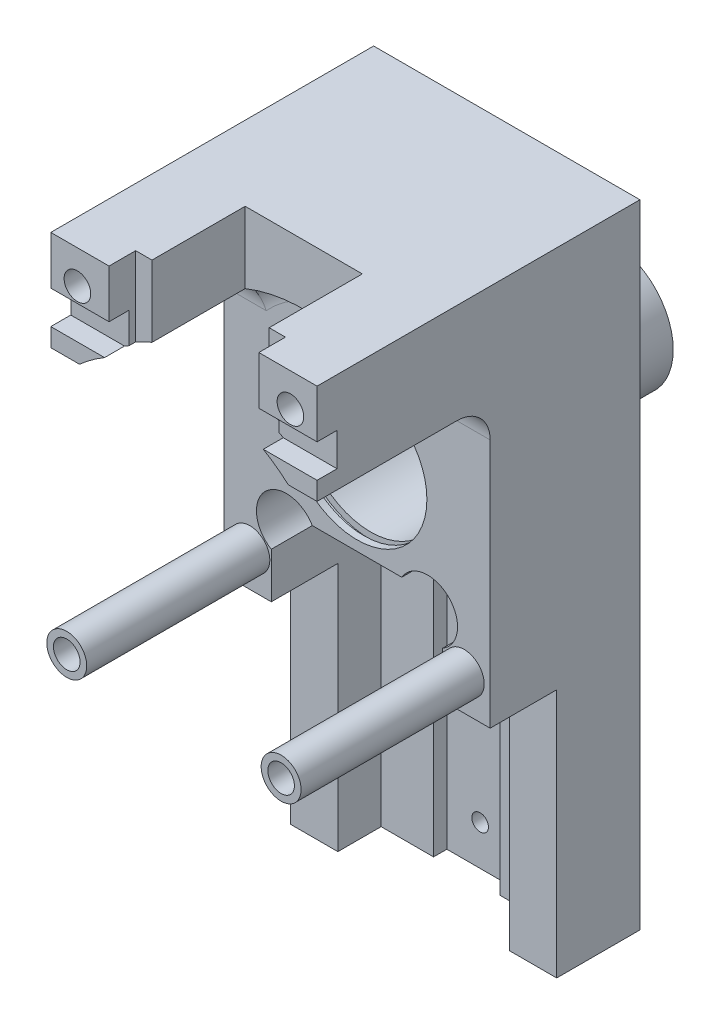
ISO-10303-21;
HEADER;
FILE_DESCRIPTION(('STEP AP214'),'2;1');
FILE_NAME('part.step','',(''),(''),'','','');
FILE_SCHEMA(('AUTOMOTIVE_DESIGN { 1 0 10303 214 1 1 1 1 }'));
ENDSEC;
DATA;
#1=APPLICATION_CONTEXT('core data for automotive mechanical design processes');
#2=APPLICATION_PROTOCOL_DEFINITION('international standard','automotive_design',2000,#1);
#3=PRODUCT_CONTEXT('',#1,'mechanical');
#4=PRODUCT('Part','Part','',(#3));
#5=PRODUCT_RELATED_PRODUCT_CATEGORY('part','',(#4));
#6=PRODUCT_DEFINITION_FORMATION('','',#4);
#7=PRODUCT_DEFINITION_CONTEXT('part definition',#1,'design');
#8=PRODUCT_DEFINITION('design','',#6,#7);
#9=PRODUCT_DEFINITION_SHAPE('','',#8);
#10=(LENGTH_UNIT() NAMED_UNIT(*) SI_UNIT(.MILLI.,.METRE.));
#11=(NAMED_UNIT(*) PLANE_ANGLE_UNIT() SI_UNIT($,.RADIAN.));
#12=(NAMED_UNIT(*) SI_UNIT($,.STERADIAN.) SOLID_ANGLE_UNIT());
#13=UNCERTAINTY_MEASURE_WITH_UNIT(LENGTH_MEASURE(1.E-05),#10,'distance_accuracy_value','');
#14=(GEOMETRIC_REPRESENTATION_CONTEXT(3) GLOBAL_UNCERTAINTY_ASSIGNED_CONTEXT((#13)) GLOBAL_UNIT_ASSIGNED_CONTEXT((#10,
#11,#12)) REPRESENTATION_CONTEXT('',''));
#15=CARTESIAN_POINT('',(0.,0.,0.));
#16=DIRECTION('',(0.,0.,1.));
#17=DIRECTION('',(1.,0.,0.));
#18=AXIS2_PLACEMENT_3D('',#15,#16,#17);
#19=CARTESIAN_POINT('',(-21.2132034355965,-21.0367965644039,-33.));
#20=DIRECTION('',(0.,0.,1.));
#21=DIRECTION('',(1.,0.,0.));
#22=AXIS2_PLACEMENT_3D('',#19,#20,#21);
#23=PLANE('',#22);
#24=DIRECTION('',(0.,-1.,0.));
#25=VECTOR('',#24,1.);
#26=CARTESIAN_POINT('',(-10.,-117.5,-33.));
#27=LINE('',#26,#25);
#28=CARTESIAN_POINT('',(-10.,-34.5,-33.));
#29=VERTEX_POINT('',#28);
#30=CARTESIAN_POINT('',(-10.,-117.5,-33.));
#31=VERTEX_POINT('',#30);
#32=EDGE_CURVE('E322',#29,#31,#27,.T.);
#33=ORIENTED_EDGE('',*,*,#32,.F.);
#34=CARTESIAN_POINT('',(-10.,-25.5,-33.));
#35=DIRECTION('',(0.,0.,1.));
#36=DIRECTION('',(1.,0.,0.));
#37=AXIS2_PLACEMENT_3D('',#34,#35,#36);
#38=CIRCLE('',#37,9.);
#39=CARTESIAN_POINT('',(-10.,-16.5,-33.));
#40=VERTEX_POINT('',#39);
#41=EDGE_CURVE('E335',#40,#29,#38,.T.);
#42=ORIENTED_EDGE('',*,*,#41,.F.);
#43=DIRECTION('',(-1.,0.,0.));
#44=VECTOR('',#43,1.);
#45=CARTESIAN_POINT('',(-13.440335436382,-16.5,-33.));
#46=LINE('',#45,#44);
#47=CARTESIAN_POINT('',(-13.440335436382,-16.5,-33.));
#48=VERTEX_POINT('',#47);
#49=EDGE_CURVE('E376',#40,#48,#46,.T.);
#50=ORIENTED_EDGE('',*,*,#49,.T.);
#51=CARTESIAN_POINT('',(-21.2132034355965,-21.0367965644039,-33.));
#52=DIRECTION('',(0.,0.,1.));
#53=DIRECTION('',(1.,0.,0.));
#54=AXIS2_PLACEMENT_3D('',#51,#52,#53);
#55=CIRCLE('',#54,9.);
#56=CARTESIAN_POINT('',(-25.75,-28.8096645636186,-33.));
#57=VERTEX_POINT('',#56);
#58=EDGE_CURVE('E380',#48,#57,#55,.T.);
#59=ORIENTED_EDGE('',*,*,#58,.T.);
#60=DIRECTION('',(0.,-1.,0.));
#61=VECTOR('',#60,1.);
#62=CARTESIAN_POINT('',(-25.75,-28.8096645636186,-33.));
#63=LINE('',#62,#61);
#64=CARTESIAN_POINT('',(-25.75,-117.5,-33.));
#65=VERTEX_POINT('',#64);
#66=EDGE_CURVE('E55',#57,#65,#63,.T.);
#67=ORIENTED_EDGE('',*,*,#66,.T.);
#68=DIRECTION('',(1.,0.,0.));
#69=VECTOR('',#68,1.);
#70=CARTESIAN_POINT('',(-25.75,-117.5,-33.));
#71=LINE('',#70,#69);
#72=EDGE_CURVE('E384',#65,#31,#71,.T.);
#73=ORIENTED_EDGE('',*,*,#72,.T.);
#74=EDGE_LOOP('',(#33,#42,#50,#59,#67,#73));
#75=FACE_BOUND('',#74,.T.);
#76=ADVANCED_FACE('F31',(#75),#23,.T.);
#77=CARTESIAN_POINT('',(40.,-42.5,-20.));
#78=DIRECTION('',(0.,1.,0.));
#79=DIRECTION('',(0.,0.,1.));
#80=AXIS2_PLACEMENT_3D('',#77,#78,#79);
#81=PLANE('',#80);
#82=DIRECTION('',(-1.,0.,0.));
#83=VECTOR('',#82,1.);
#84=CARTESIAN_POINT('',(40.,-42.5,0.));
#85=LINE('',#84,#83);
#86=CARTESIAN_POINT('',(40.,-42.5,0.));
#87=VERTEX_POINT('',#86);
#88=CARTESIAN_POINT('',(25.75,-42.5,0.));
#89=VERTEX_POINT('',#88);
#90=EDGE_CURVE('E654',#87,#89,#85,.T.);
#91=ORIENTED_EDGE('',*,*,#90,.T.);
#92=DIRECTION('',(0.,0.,-1.));
#93=VECTOR('',#92,1.);
#94=CARTESIAN_POINT('',(25.75,-42.5,-20.));
#95=LINE('',#94,#93);
#96=CARTESIAN_POINT('',(25.75,-42.5,-20.));
#97=VERTEX_POINT('',#96);
#98=EDGE_CURVE('E420',#89,#97,#95,.T.);
#99=ORIENTED_EDGE('',*,*,#98,.T.);
#100=DIRECTION('',(-1.,0.,0.));
#101=VECTOR('',#100,1.);
#102=CARTESIAN_POINT('',(40.,-42.5,-20.));
#103=LINE('',#102,#101);
#104=CARTESIAN_POINT('',(40.,-42.5,-20.));
#105=VERTEX_POINT('',#104);
#106=EDGE_CURVE('E650',#105,#97,#103,.T.);
#107=ORIENTED_EDGE('',*,*,#106,.F.);
#108=DIRECTION('',(0.,0.,-1.));
#109=VECTOR('',#108,1.);
#110=CARTESIAN_POINT('',(40.,-42.5,-20.));
#111=LINE('',#110,#109);
#112=EDGE_CURVE('E593',#87,#105,#111,.T.);
#113=ORIENTED_EDGE('',*,*,#112,.F.);
#114=EDGE_LOOP('',(#91,#99,#107,#113));
#115=FACE_BOUND('',#114,.T.);
#116=ADVANCED_FACE('F735',(#115),#81,.F.);
#117=CARTESIAN_POINT('',(40.,-117.5,-20.));
#118=DIRECTION('',(0.,0.,-1.));
#119=DIRECTION('',(-1.,0.,0.));
#120=AXIS2_PLACEMENT_3D('',#117,#118,#119);
#121=PLANE('',#120);
#122=ORIENTED_EDGE('',*,*,#106,.T.);
#123=DIRECTION('',(0.,-1.,0.));
#124=VECTOR('',#123,1.);
#125=CARTESIAN_POINT('',(25.75,-117.5,-20.));
#126=LINE('',#125,#124);
#127=CARTESIAN_POINT('',(25.75,-117.5,-20.));
#128=VERTEX_POINT('',#127);
#129=EDGE_CURVE('E417',#97,#128,#126,.T.);
#130=ORIENTED_EDGE('',*,*,#129,.T.);
#131=DIRECTION('',(-1.,0.,0.));
#132=VECTOR('',#131,1.);
#133=CARTESIAN_POINT('',(40.,-117.5,-20.));
#134=LINE('',#133,#132);
#135=CARTESIAN_POINT('',(40.,-117.5,-20.));
#136=VERTEX_POINT('',#135);
#137=EDGE_CURVE('E646',#136,#128,#134,.T.);
#138=ORIENTED_EDGE('',*,*,#137,.F.);
#139=DIRECTION('',(0.,-1.,0.));
#140=VECTOR('',#139,1.);
#141=CARTESIAN_POINT('',(40.,-117.5,-20.));
#142=LINE('',#141,#140);
#143=EDGE_CURVE('E595',#105,#136,#142,.T.);
#144=ORIENTED_EDGE('',*,*,#143,.F.);
#145=EDGE_LOOP('',(#122,#130,#138,#144));
#146=FACE_BOUND('',#145,.T.);
#147=ADVANCED_FACE('F741',(#146),#121,.F.);
#148=CARTESIAN_POINT('',(-17.6,72.5,16.));
#149=DIRECTION('',(-1.,0.,0.));
#150=DIRECTION('',(0.,-1.,0.));
#151=AXIS2_PLACEMENT_3D('',#148,#149,#150);
#152=PLANE('',#151);
#153=DIRECTION('',(0.,1.,0.));
#154=VECTOR('',#153,1.);
#155=CARTESIAN_POINT('',(-17.6,72.5,44.));
#156=LINE('',#155,#154);
#157=CARTESIAN_POINT('',(-17.6,51.0802707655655,44.));
#158=VERTEX_POINT('',#157);
#159=CARTESIAN_POINT('',(-17.6,72.5,44.));
#160=VERTEX_POINT('',#159);
#161=EDGE_CURVE('E442',#158,#160,#156,.T.);
#162=ORIENTED_EDGE('',*,*,#161,.F.);
#163=DIRECTION('',(0.,0.,1.));
#164=VECTOR('',#163,1.);
#165=CARTESIAN_POINT('',(-17.6,51.0802707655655,-132.936074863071));
#166=LINE('',#165,#164);
#167=CARTESIAN_POINT('',(-17.6,51.0802707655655,16.));
#168=VERTEX_POINT('',#167);
#169=EDGE_CURVE('E687',#168,#158,#166,.T.);
#170=ORIENTED_EDGE('',*,*,#169,.F.);
#171=DIRECTION('',(0.,-1.,0.));
#172=VECTOR('',#171,1.);
#173=CARTESIAN_POINT('',(-17.6,72.5,16.));
#174=LINE('',#173,#172);
#175=CARTESIAN_POINT('',(-17.6,72.5,16.));
#176=VERTEX_POINT('',#175);
#177=EDGE_CURVE('E512',#176,#168,#174,.T.);
#178=ORIENTED_EDGE('',*,*,#177,.F.);
#179=DIRECTION('',(0.,0.,1.));
#180=VECTOR('',#179,1.);
#181=CARTESIAN_POINT('',(-17.6,72.5,16.));
#182=LINE('',#181,#180);
#183=EDGE_CURVE('E521',#176,#160,#182,.T.);
#184=ORIENTED_EDGE('',*,*,#183,.T.);
#185=EDGE_LOOP('',(#162,#170,#178,#184));
#186=FACE_BOUND('',#185,.T.);
#187=ADVANCED_FACE('F918',(#186),#152,.F.);
#188=CARTESIAN_POINT('',(17.6,72.5,16.));
#189=DIRECTION('',(1.,0.,0.));
#190=DIRECTION('',(0.,1.,0.));
#191=AXIS2_PLACEMENT_3D('',#188,#189,#190);
#192=PLANE('',#191);
#193=DIRECTION('',(0.,-1.,0.));
#194=VECTOR('',#193,1.);
#195=CARTESIAN_POINT('',(17.6,72.5,44.));
#196=LINE('',#195,#194);
#197=CARTESIAN_POINT('',(17.6,72.5,44.));
#198=VERTEX_POINT('',#197);
#199=CARTESIAN_POINT('',(17.6,51.0802707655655,44.));
#200=VERTEX_POINT('',#199);
#201=EDGE_CURVE('E1006',#198,#200,#196,.T.);
#202=ORIENTED_EDGE('',*,*,#201,.F.);
#203=DIRECTION('',(0.,0.,1.));
#204=VECTOR('',#203,1.);
#205=CARTESIAN_POINT('',(17.6,72.5,16.));
#206=LINE('',#205,#204);
#207=CARTESIAN_POINT('',(17.6,72.5,16.));
#208=VERTEX_POINT('',#207);
#209=EDGE_CURVE('E520',#208,#198,#206,.T.);
#210=ORIENTED_EDGE('',*,*,#209,.F.);
#211=DIRECTION('',(0.,1.,0.));
#212=VECTOR('',#211,1.);
#213=CARTESIAN_POINT('',(17.6,72.5,16.));
#214=LINE('',#213,#212);
#215=CARTESIAN_POINT('',(17.6,51.0802707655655,16.));
#216=VERTEX_POINT('',#215);
#217=EDGE_CURVE('E514',#216,#208,#214,.T.);
#218=ORIENTED_EDGE('',*,*,#217,.F.);
#219=DIRECTION('',(0.,0.,1.));
#220=VECTOR('',#219,1.);
#221=CARTESIAN_POINT('',(17.6,51.0802707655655,-132.936074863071));
#222=LINE('',#221,#220);
#223=EDGE_CURVE('E685',#200,#216,#222,.F.);
#224=ORIENTED_EDGE('',*,*,#223,.F.);
#225=EDGE_LOOP('',(#202,#210,#218,#224));
#226=FACE_BOUND('',#225,.T.);
#227=ADVANCED_FACE('F854',(#226),#192,.F.);
#228=CARTESIAN_POINT('',(40.,-42.5,0.));
#229=DIRECTION('',(0.,0.,-1.));
#230=DIRECTION('',(-1.,0.,0.));
#231=AXIS2_PLACEMENT_3D('',#228,#229,#230);
#232=PLANE('',#231);
#233=CARTESIAN_POINT('',(-32.2,-31.9,0.));
#234=DIRECTION('',(0.,0.,-1.));
#235=DIRECTION('',(-1.,0.,0.));
#236=AXIS2_PLACEMENT_3D('',#233,#234,#235);
#237=CIRCLE('',#236,6.);
#238=CARTESIAN_POINT('',(-38.2,-31.9,0.));
#239=VERTEX_POINT('',#238);
#240=EDGE_CURVE('E707',#239,#239,#237,.F.);
#241=ORIENTED_EDGE('',*,*,#240,.F.);
#242=EDGE_LOOP('',(#241));
#243=FACE_BOUND('',#242,.T.);
#244=CARTESIAN_POINT('',(21.2132034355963,-21.0367965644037,0.));
#245=DIRECTION('',(0.,0.,1.));
#246=DIRECTION('',(1.,0.,0.));
#247=AXIS2_PLACEMENT_3D('',#244,#245,#246);
#248=CIRCLE('',#247,9.);
#249=CARTESIAN_POINT('',(25.75,-28.8096645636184,0.));
#250=VERTEX_POINT('',#249);
#251=CARTESIAN_POINT('',(13.4403354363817,-16.5,0.));
#252=VERTEX_POINT('',#251);
#253=EDGE_CURVE('E388',#250,#252,#248,.T.);
#254=ORIENTED_EDGE('',*,*,#253,.F.);
#255=DIRECTION('',(0.,1.,0.));
#256=VECTOR('',#255,1.);
#257=CARTESIAN_POINT('',(25.75,-28.8096645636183,0.));
#258=LINE('',#257,#256);
#259=EDGE_CURVE('E361',#89,#250,#258,.T.);
#260=ORIENTED_EDGE('',*,*,#259,.F.);
#261=ORIENTED_EDGE('',*,*,#90,.F.);
#262=DIRECTION('',(0.,-1.,0.));
#263=VECTOR('',#262,1.);
#264=CARTESIAN_POINT('',(40.,-42.5,0.));
#265=LINE('',#264,#263);
#266=CARTESIAN_POINT('',(40.,32.5,0.));
#267=VERTEX_POINT('',#266);
#268=EDGE_CURVE('E591',#267,#87,#265,.T.);
#269=ORIENTED_EDGE('',*,*,#268,.F.);
#270=DIRECTION('',(-1.,0.,0.));
#271=VECTOR('',#270,1.);
#272=CARTESIAN_POINT('',(31.3687742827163,32.5,0.));
#273=LINE('',#272,#271);
#274=CARTESIAN_POINT('',(27.2763633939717,32.5,0.));
#275=VERTEX_POINT('',#274);
#276=EDGE_CURVE('E694',#267,#275,#273,.T.);
#277=ORIENTED_EDGE('',*,*,#276,.T.);
#278=CARTESIAN_POINT('',(0.,7.50000000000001,0.));
#279=DIRECTION('',(0.,0.,-1.));
#280=DIRECTION('',(-1.,0.,0.));
#281=AXIS2_PLACEMENT_3D('',#278,#279,#280);
#282=CIRCLE('',#281,37.);
#283=CARTESIAN_POINT('',(-27.2763633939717,32.5,0.));
#284=VERTEX_POINT('',#283);
#285=EDGE_CURVE('E690',#275,#284,#282,.F.);
#286=ORIENTED_EDGE('',*,*,#285,.T.);
#287=DIRECTION('',(-1.,0.,0.));
#288=VECTOR('',#287,1.);
#289=CARTESIAN_POINT('',(-40.,32.5,0.));
#290=LINE('',#289,#288);
#291=CARTESIAN_POINT('',(-40.,32.5,0.));
#292=VERTEX_POINT('',#291);
#293=EDGE_CURVE('E692',#284,#292,#290,.T.);
#294=ORIENTED_EDGE('',*,*,#293,.T.);
#295=DIRECTION('',(0.,-1.,0.));
#296=VECTOR('',#295,1.);
#297=CARTESIAN_POINT('',(-40.,-42.5,0.));
#298=LINE('',#297,#296);
#299=CARTESIAN_POINT('',(-40.,-42.5,0.));
#300=VERTEX_POINT('',#299);
#301=EDGE_CURVE('E621',#292,#300,#298,.T.);
#302=ORIENTED_EDGE('',*,*,#301,.T.);
#303=CARTESIAN_POINT('',(-25.75,-42.5,0.));
#304=VERTEX_POINT('',#303);
#305=EDGE_CURVE('E653',#304,#300,#85,.T.);
#306=ORIENTED_EDGE('',*,*,#305,.F.);
#307=DIRECTION('',(0.,-1.,0.));
#308=VECTOR('',#307,1.);
#309=CARTESIAN_POINT('',(-25.75,-28.8096645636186,0.));
#310=LINE('',#309,#308);
#311=CARTESIAN_POINT('',(-25.75,-28.8096645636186,0.));
#312=VERTEX_POINT('',#311);
#313=EDGE_CURVE('E373',#312,#304,#310,.T.);
#314=ORIENTED_EDGE('',*,*,#313,.F.);
#315=CARTESIAN_POINT('',(-21.2132034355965,-21.0367965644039,0.));
#316=DIRECTION('',(0.,0.,1.));
#317=DIRECTION('',(1.,0.,0.));
#318=AXIS2_PLACEMENT_3D('',#315,#316,#317);
#319=CIRCLE('',#318,9.);
#320=CARTESIAN_POINT('',(-13.440335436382,-16.5,0.));
#321=VERTEX_POINT('',#320);
#322=EDGE_CURVE('E394',#321,#312,#319,.T.);
#323=ORIENTED_EDGE('',*,*,#322,.F.);
#324=DIRECTION('',(-1.,0.,0.));
#325=VECTOR('',#324,1.);
#326=CARTESIAN_POINT('',(-13.440335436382,-16.5,0.));
#327=LINE('',#326,#325);
#328=EDGE_CURVE('E391',#252,#321,#327,.T.);
#329=ORIENTED_EDGE('',*,*,#328,.F.);
#330=EDGE_LOOP('',(#254,#260,#261,#269,#277,#286,#294,#302,#306,#314,#323,#329));
#331=FACE_BOUND('',#330,.T.);
#332=CARTESIAN_POINT('',(0.,7.50000000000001,0.));
#333=DIRECTION('',(0.,0.,1.));
#334=DIRECTION('',(1.,0.,0.));
#335=AXIS2_PLACEMENT_3D('',#332,#333,#334);
#336=CIRCLE('',#335,21.);
#337=CARTESIAN_POINT('',(21.,7.50000000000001,0.));
#338=VERTEX_POINT('',#337);
#339=EDGE_CURVE('E567',#338,#338,#336,.T.);
#340=ORIENTED_EDGE('',*,*,#339,.F.);
#341=EDGE_LOOP('',(#340));
#342=FACE_BOUND('',#341,.T.);
#343=CARTESIAN_POINT('',(32.2,-31.9,0.));
#344=DIRECTION('',(0.,0.,-1.));
#345=DIRECTION('',(-1.,0.,0.));
#346=AXIS2_PLACEMENT_3D('',#343,#344,#345);
#347=CIRCLE('',#346,5.99999999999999);
#348=CARTESIAN_POINT('',(26.2,-31.9,0.));
#349=VERTEX_POINT('',#348);
#350=EDGE_CURVE('E1007',#349,#349,#347,.F.);
#351=ORIENTED_EDGE('',*,*,#350,.F.);
#352=EDGE_LOOP('',(#351));
#353=FACE_BOUND('',#352,.T.);
#354=ADVANCED_FACE('F850',(#243,#331,#342,#353),#232,.F.);
#355=CARTESIAN_POINT('',(40.,58.,52.));
#356=DIRECTION('',(0.,0.,-1.));
#357=DIRECTION('',(-1.,0.,0.));
#358=AXIS2_PLACEMENT_3D('',#355,#356,#357);
#359=PLANE('',#358);
#360=CARTESIAN_POINT('',(-32.,62.5,52.));
#361=DIRECTION('',(0.,0.,1.));
#362=DIRECTION('',(1.,0.,0.));
#363=AXIS2_PLACEMENT_3D('',#360,#361,#362);
#364=CIRCLE('',#363,4.);
#365=CARTESIAN_POINT('',(-28.,62.5,52.));
#366=VERTEX_POINT('',#365);
#367=EDGE_CURVE('E508',#366,#366,#364,.T.);
#368=ORIENTED_EDGE('',*,*,#367,.F.);
#369=EDGE_LOOP('',(#368));
#370=FACE_BOUND('',#369,.T.);
#371=DIRECTION('',(-1.,0.,0.));
#372=VECTOR('',#371,1.);
#373=CARTESIAN_POINT('',(40.,58.,52.));
#374=LINE('',#373,#372);
#375=CARTESIAN_POINT('',(-22.5,58.,52.));
#376=VERTEX_POINT('',#375);
#377=CARTESIAN_POINT('',(-40.,58.,52.));
#378=VERTEX_POINT('',#377);
#379=EDGE_CURVE('E673',#376,#378,#374,.T.);
#380=ORIENTED_EDGE('',*,*,#379,.F.);
#381=DIRECTION('',(0.,-1.,0.));
#382=VECTOR('',#381,1.);
#383=CARTESIAN_POINT('',(-22.5,72.5,52.));
#384=LINE('',#383,#382);
#385=CARTESIAN_POINT('',(-22.5,72.5,52.));
#386=VERTEX_POINT('',#385);
#387=EDGE_CURVE('E423',#386,#376,#384,.T.);
#388=ORIENTED_EDGE('',*,*,#387,.F.);
#389=DIRECTION('',(-1.,0.,0.));
#390=VECTOR('',#389,1.);
#391=CARTESIAN_POINT('',(40.,72.5,52.));
#392=LINE('',#391,#390);
#393=CARTESIAN_POINT('',(-40.,72.5,52.));
#394=VERTEX_POINT('',#393);
#395=EDGE_CURVE('E603',#386,#394,#392,.T.);
#396=ORIENTED_EDGE('',*,*,#395,.T.);
#397=DIRECTION('',(0.,-1.,0.));
#398=VECTOR('',#397,1.);
#399=CARTESIAN_POINT('',(-40.,58.,52.));
#400=LINE('',#399,#398);
#401=EDGE_CURVE('E575',#394,#378,#400,.T.);
#402=ORIENTED_EDGE('',*,*,#401,.T.);
#403=EDGE_LOOP('',(#380,#388,#396,#402));
#404=FACE_BOUND('',#403,.T.);
#405=ADVANCED_FACE('F853',(#370,#404),#359,.F.);
#406=CARTESIAN_POINT('',(40.,58.,46.));
#407=DIRECTION('',(0.,1.,0.));
#408=DIRECTION('',(0.,0.,1.));
#409=AXIS2_PLACEMENT_3D('',#406,#407,#408);
#410=PLANE('',#409);
#411=DIRECTION('',(-1.,0.,0.));
#412=VECTOR('',#411,1.);
#413=CARTESIAN_POINT('',(40.,58.,46.));
#414=LINE('',#413,#412);
#415=CARTESIAN_POINT('',(-22.5,58.,46.));
#416=VERTEX_POINT('',#415);
#417=CARTESIAN_POINT('',(-40.,58.,46.));
#418=VERTEX_POINT('',#417);
#419=EDGE_CURVE('E669',#416,#418,#414,.T.);
#420=ORIENTED_EDGE('',*,*,#419,.F.);
#421=DIRECTION('',(0.,0.,1.));
#422=VECTOR('',#421,1.);
#423=CARTESIAN_POINT('',(-22.5,58.,46.));
#424=LINE('',#423,#422);
#425=EDGE_CURVE('E454',#416,#376,#424,.T.);
#426=ORIENTED_EDGE('',*,*,#425,.T.);
#427=ORIENTED_EDGE('',*,*,#379,.T.);
#428=DIRECTION('',(0.,0.,-1.));
#429=VECTOR('',#428,1.);
#430=CARTESIAN_POINT('',(-40.,58.,46.));
#431=LINE('',#430,#429);
#432=EDGE_CURVE('E606',#378,#418,#431,.T.);
#433=ORIENTED_EDGE('',*,*,#432,.T.);
#434=EDGE_LOOP('',(#420,#426,#427,#433));
#435=FACE_BOUND('',#434,.T.);
#436=ADVANCED_FACE('F878',(#435),#410,.F.);
#437=CARTESIAN_POINT('',(40.,48.,46.));
#438=DIRECTION('',(0.,0.,-1.));
#439=DIRECTION('',(-1.,0.,0.));
#440=AXIS2_PLACEMENT_3D('',#437,#438,#439);
#441=PLANE('',#440);
#442=CARTESIAN_POINT('',(0.,7.50000000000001,46.));
#443=DIRECTION('',(0.,0.,-1.));
#444=DIRECTION('',(-1.,0.,0.));
#445=AXIS2_PLACEMENT_3D('',#442,#443,#444);
#446=CIRCLE('',#445,47.);
#447=CARTESIAN_POINT('',(-23.8484800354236,48.,46.));
#448=VERTEX_POINT('',#447);
#449=CARTESIAN_POINT('',(-22.5,48.7643914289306,45.9999999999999));
#450=VERTEX_POINT('',#449);
#451=EDGE_CURVE('E538',#448,#450,#446,.T.);
#452=ORIENTED_EDGE('',*,*,#451,.T.);
#453=DIRECTION('',(0.,1.,0.));
#454=VECTOR('',#453,1.);
#455=CARTESIAN_POINT('',(-22.5,48.,46.));
#456=LINE('',#455,#454);
#457=EDGE_CURVE('E451',#450,#416,#456,.T.);
#458=ORIENTED_EDGE('',*,*,#457,.T.);
#459=ORIENTED_EDGE('',*,*,#419,.T.);
#460=DIRECTION('',(0.,-1.,0.));
#461=VECTOR('',#460,1.);
#462=CARTESIAN_POINT('',(-40.,48.,46.));
#463=LINE('',#462,#461);
#464=CARTESIAN_POINT('',(-40.,48.,46.));
#465=VERTEX_POINT('',#464);
#466=EDGE_CURVE('E609',#418,#465,#463,.T.);
#467=ORIENTED_EDGE('',*,*,#466,.T.);
#468=DIRECTION('',(-1.,0.,0.));
#469=VECTOR('',#468,1.);
#470=CARTESIAN_POINT('',(40.,48.,46.));
#471=LINE('',#470,#469);
#472=EDGE_CURVE('E665',#448,#465,#471,.T.);
#473=ORIENTED_EDGE('',*,*,#472,.F.);
#474=EDGE_LOOP('',(#452,#458,#459,#467,#473));
#475=FACE_BOUND('',#474,.T.);
#476=ADVANCED_FACE('F875',(#475),#441,.F.);
#477=CARTESIAN_POINT('',(40.,48.,52.));
#478=DIRECTION('',(0.,-1.,0.));
#479=DIRECTION('',(0.,0.,-1.));
#480=AXIS2_PLACEMENT_3D('',#477,#478,#479);
#481=PLANE('',#480);
#482=CARTESIAN_POINT('',(40.,48.,46.));
#483=VERTEX_POINT('',#482);
#484=CARTESIAN_POINT('',(23.8484800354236,48.,46.));
#485=VERTEX_POINT('',#484);
#486=EDGE_CURVE('E666',#483,#485,#471,.T.);
#487=ORIENTED_EDGE('',*,*,#486,.T.);
#488=DIRECTION('',(0.,0.,1.));
#489=VECTOR('',#488,1.);
#490=CARTESIAN_POINT('',(23.8484800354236,48.,-132.936074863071));
#491=LINE('',#490,#489);
#492=CARTESIAN_POINT('',(23.8484800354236,48.,52.));
#493=VERTEX_POINT('',#492);
#494=EDGE_CURVE('E541',#485,#493,#491,.T.);
#495=ORIENTED_EDGE('',*,*,#494,.T.);
#496=DIRECTION('',(-1.,0.,0.));
#497=VECTOR('',#496,1.);
#498=CARTESIAN_POINT('',(40.,48.,52.));
#499=LINE('',#498,#497);
#500=CARTESIAN_POINT('',(40.,48.,52.));
#501=VERTEX_POINT('',#500);
#502=EDGE_CURVE('E662',#501,#493,#499,.T.);
#503=ORIENTED_EDGE('',*,*,#502,.F.);
#504=DIRECTION('',(0.,0.,1.));
#505=VECTOR('',#504,1.);
#506=CARTESIAN_POINT('',(40.,48.,52.));
#507=LINE('',#506,#505);
#508=EDGE_CURVE('E584',#483,#501,#507,.T.);
#509=ORIENTED_EDGE('',*,*,#508,.F.);
#510=EDGE_LOOP('',(#487,#495,#503,#509));
#511=FACE_BOUND('',#510,.T.);
#512=ADVANCED_FACE('F870',(#511),#481,.F.);
#513=CARTESIAN_POINT('',(40.,42.5,52.));
#514=DIRECTION('',(0.,0.,-1.));
#515=DIRECTION('',(-1.,0.,0.));
#516=AXIS2_PLACEMENT_3D('',#513,#514,#515);
#517=PLANE('',#516);
#518=DIRECTION('',(-1.,0.,0.));
#519=VECTOR('',#518,1.);
#520=CARTESIAN_POINT('',(40.,42.5,52.));
#521=LINE('',#520,#519);
#522=CARTESIAN_POINT('',(-31.3687742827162,42.5,52.));
#523=VERTEX_POINT('',#522);
#524=CARTESIAN_POINT('',(-40.,42.5,52.));
#525=VERTEX_POINT('',#524);
#526=EDGE_CURVE('E657',#523,#525,#521,.T.);
#527=ORIENTED_EDGE('',*,*,#526,.F.);
#528=CARTESIAN_POINT('',(0.,7.50000000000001,52.));
#529=DIRECTION('',(0.,0.,1.));
#530=DIRECTION('',(1.,0.,0.));
#531=AXIS2_PLACEMENT_3D('',#528,#529,#530);
#532=CIRCLE('',#531,47.);
#533=CARTESIAN_POINT('',(-23.8484800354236,48.,52.));
#534=VERTEX_POINT('',#533);
#535=EDGE_CURVE('E524',#534,#523,#532,.T.);
#536=ORIENTED_EDGE('',*,*,#535,.F.);
#537=CARTESIAN_POINT('',(-40.,48.,52.));
#538=VERTEX_POINT('',#537);
#539=EDGE_CURVE('E661',#534,#538,#499,.T.);
#540=ORIENTED_EDGE('',*,*,#539,.T.);
#541=DIRECTION('',(0.,-1.,0.));
#542=VECTOR('',#541,1.);
#543=CARTESIAN_POINT('',(-40.,42.5,52.));
#544=LINE('',#543,#542);
#545=EDGE_CURVE('E615',#538,#525,#544,.T.);
#546=ORIENTED_EDGE('',*,*,#545,.T.);
#547=EDGE_LOOP('',(#527,#536,#540,#546));
#548=FACE_BOUND('',#547,.T.);
#549=ADVANCED_FACE('F865',(#548),#517,.F.);
#550=CARTESIAN_POINT('',(40.,42.5,0.));
#551=DIRECTION('',(0.,1.,0.));
#552=DIRECTION('',(0.,0.,1.));
#553=AXIS2_PLACEMENT_3D('',#550,#551,#552);
#554=PLANE('',#553);
#555=DIRECTION('',(0.,0.,-1.));
#556=VECTOR('',#555,1.);
#557=CARTESIAN_POINT('',(-40.,42.5,0.));
#558=LINE('',#557,#556);
#559=CARTESIAN_POINT('',(-40.,42.5,10.));
#560=VERTEX_POINT('',#559);
#561=EDGE_CURVE('E618',#525,#560,#558,.T.);
#562=ORIENTED_EDGE('',*,*,#561,.T.);
#563=DIRECTION('',(-1.,0.,0.));
#564=VECTOR('',#563,1.);
#565=CARTESIAN_POINT('',(-31.3687742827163,42.5,10.));
#566=LINE('',#565,#564);
#567=CARTESIAN_POINT('',(-31.3687742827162,42.5,9.99999999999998));
#568=VERTEX_POINT('',#567);
#569=EDGE_CURVE('E699',#560,#568,#566,.F.);
#570=ORIENTED_EDGE('',*,*,#569,.T.);
#571=DIRECTION('',(0.,0.,1.));
#572=VECTOR('',#571,1.);
#573=CARTESIAN_POINT('',(-31.3687742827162,42.5,-132.936074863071));
#574=LINE('',#573,#572);
#575=EDGE_CURVE('E532',#568,#523,#574,.T.);
#576=ORIENTED_EDGE('',*,*,#575,.T.);
#577=ORIENTED_EDGE('',*,*,#526,.T.);
#578=EDGE_LOOP('',(#562,#570,#576,#577));
#579=FACE_BOUND('',#578,.T.);
#580=ADVANCED_FACE('F860',(#579),#554,.F.);
#581=CARTESIAN_POINT('',(0.,7.50000000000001,-34.));
#582=DIRECTION('',(0.,0.,1.));
#583=DIRECTION('',(1.,0.,0.));
#584=AXIS2_PLACEMENT_3D('',#581,#582,#583);
#585=CYLINDRICAL_SURFACE('',#584,21.);
#586=CARTESIAN_POINT('',(0.,7.5,-2.1));
#587=DIRECTION('',(0.,0.,-1.));
#588=DIRECTION('',(-1.,0.,0.));
#589=AXIS2_PLACEMENT_3D('',#586,#587,#588);
#590=CIRCLE('',#589,21.);
#591=CARTESIAN_POINT('',(-21.,7.5,-2.1));
#592=VERTEX_POINT('',#591);
#593=EDGE_CURVE('E553',#592,#592,#590,.T.);
#594=ORIENTED_EDGE('',*,*,#593,.T.);
#595=EDGE_LOOP('',(#594));
#596=FACE_BOUND('',#595,.T.);
#597=ORIENTED_EDGE('',*,*,#339,.T.);
#598=EDGE_LOOP('',(#597));
#599=FACE_BOUND('',#598,.T.);
#600=ADVANCED_FACE('F975',(#596,#599),#585,.F.);
#601=CARTESIAN_POINT('',(0.,7.50000000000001,52.001));
#602=DIRECTION('',(0.,0.,-1.));
#603=DIRECTION('',(0.,1.,0.));
#604=AXIS2_PLACEMENT_3D('',#601,#602,#603);
#605=CYLINDRICAL_SURFACE('',#604,11.5);
#606=CARTESIAN_POINT('',(0.,7.50000000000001,-76.));
#607=DIRECTION('',(0.,0.,-1.));
#608=DIRECTION('',(0.,1.,0.));
#609=AXIS2_PLACEMENT_3D('',#606,#607,#608);
#610=CIRCLE('',#609,11.5);
#611=CARTESIAN_POINT('',(0.,19.,-76.));
#612=VERTEX_POINT('',#611);
#613=EDGE_CURVE('E566',#612,#612,#610,.T.);
#614=ORIENTED_EDGE('',*,*,#613,.T.);
#615=EDGE_LOOP('',(#614));
#616=FACE_BOUND('',#615,.T.);
#617=CARTESIAN_POINT('',(0.,7.50000000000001,-38.));
#618=DIRECTION('',(0.,0.,1.));
#619=DIRECTION('',(1.,0.,0.));
#620=AXIS2_PLACEMENT_3D('',#617,#618,#619);
#621=CIRCLE('',#620,11.5);
#622=CARTESIAN_POINT('',(11.5,7.50000000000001,-38.));
#623=VERTEX_POINT('',#622);
#624=EDGE_CURVE('E560',#623,#623,#621,.F.);
#625=ORIENTED_EDGE('',*,*,#624,.F.);
#626=EDGE_LOOP('',(#625));
#627=FACE_BOUND('',#626,.T.);
#628=ADVANCED_FACE('F808',(#616,#627),#605,.F.);
#629=CARTESIAN_POINT('',(40.,72.5,-45.));
#630=DIRECTION('',(0.,0.,1.));
#631=DIRECTION('',(0.,-1.,0.));
#632=AXIS2_PLACEMENT_3D('',#629,#630,#631);
#633=PLANE('',#632);
#634=CARTESIAN_POINT('',(0.,-105.5,-45.));
#635=DIRECTION('',(0.,0.,1.));
#636=DIRECTION('',(0.,-1.,0.));
#637=AXIS2_PLACEMENT_3D('',#634,#635,#636);
#638=CIRCLE('',#637,2.49999999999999);
#639=CARTESIAN_POINT('',(0.,-108.,-45.));
#640=VERTEX_POINT('',#639);
#641=EDGE_CURVE('E793',#640,#640,#638,.T.);
#642=ORIENTED_EDGE('',*,*,#641,.T.);
#643=EDGE_LOOP('',(#642));
#644=FACE_BOUND('',#643,.T.);
#645=CARTESIAN_POINT('',(0.,-45.5,-45.));
#646=DIRECTION('',(0.,0.,1.));
#647=DIRECTION('',(0.,-1.,0.));
#648=AXIS2_PLACEMENT_3D('',#645,#646,#647);
#649=CIRCLE('',#648,2.49999999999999);
#650=CARTESIAN_POINT('',(0.,-48.,-45.));
#651=VERTEX_POINT('',#650);
#652=EDGE_CURVE('E352',#651,#651,#649,.T.);
#653=ORIENTED_EDGE('',*,*,#652,.T.);
#654=EDGE_LOOP('',(#653));
#655=FACE_BOUND('',#654,.T.);
#656=DIRECTION('',(0.,1.,0.));
#657=VECTOR('',#656,1.);
#658=CARTESIAN_POINT('',(-40.,72.5,-45.));
#659=LINE('',#658,#657);
#660=CARTESIAN_POINT('',(-40.,-117.5,-45.));
#661=VERTEX_POINT('',#660);
#662=CARTESIAN_POINT('',(-40.,72.5,-45.));
#663=VERTEX_POINT('',#662);
#664=EDGE_CURVE('E632',#661,#663,#659,.T.);
#665=ORIENTED_EDGE('',*,*,#664,.T.);
#666=DIRECTION('',(-1.,0.,0.));
#667=VECTOR('',#666,1.);
#668=CARTESIAN_POINT('',(40.,72.5,-45.));
#669=LINE('',#668,#667);
#670=CARTESIAN_POINT('',(40.,72.5,-45.));
#671=VERTEX_POINT('',#670);
#672=EDGE_CURVE('E639',#671,#663,#669,.T.);
#673=ORIENTED_EDGE('',*,*,#672,.F.);
#674=DIRECTION('',(0.,1.,0.));
#675=VECTOR('',#674,1.);
#676=CARTESIAN_POINT('',(40.,72.5,-45.));
#677=LINE('',#676,#675);
#678=CARTESIAN_POINT('',(40.,-117.5,-45.));
#679=VERTEX_POINT('',#678);
#680=EDGE_CURVE('E599',#679,#671,#677,.T.);
#681=ORIENTED_EDGE('',*,*,#680,.F.);
#682=DIRECTION('',(-1.,0.,0.));
#683=VECTOR('',#682,1.);
#684=CARTESIAN_POINT('',(40.,-117.5,-45.));
#685=LINE('',#684,#683);
#686=EDGE_CURVE('E642',#679,#661,#685,.T.);
#687=ORIENTED_EDGE('',*,*,#686,.T.);
#688=EDGE_LOOP('',(#665,#673,#681,#687));
#689=FACE_BOUND('',#688,.T.);
#690=CARTESIAN_POINT('',(0.,7.50000000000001,-45.));
#691=DIRECTION('',(0.,0.,1.));
#692=DIRECTION('',(0.,-1.,0.));
#693=AXIS2_PLACEMENT_3D('',#690,#691,#692);
#694=CIRCLE('',#693,19.);
#695=CARTESIAN_POINT('',(0.,-11.5,-45.));
#696=VERTEX_POINT('',#695);
#697=EDGE_CURVE('E677',#696,#696,#694,.F.);
#698=ORIENTED_EDGE('',*,*,#697,.F.);
#699=EDGE_LOOP('',(#698));
#700=FACE_BOUND('',#699,.T.);
#701=ADVANCED_FACE('F803',(#644,#655,#689,#700),#633,.F.);
#702=CARTESIAN_POINT('',(32.,62.5000000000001,52.));
#703=DIRECTION('',(0.,0.,1.));
#704=DIRECTION('',(1.,0.,0.));
#705=AXIS2_PLACEMENT_3D('',#702,#703,#704);
#706=CIRCLE('',#705,4.);
#707=CARTESIAN_POINT('',(36.,62.5000000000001,52.));
#708=VERTEX_POINT('',#707);
#709=EDGE_CURVE('E496',#708,#708,#706,.T.);
#710=ORIENTED_EDGE('',*,*,#709,.F.);
#711=EDGE_LOOP('',(#710));
#712=FACE_BOUND('',#711,.T.);
#713=CARTESIAN_POINT('',(40.,72.5,52.));
#714=VERTEX_POINT('',#713);
#715=CARTESIAN_POINT('',(22.5,72.5,52.));
#716=VERTEX_POINT('',#715);
#717=EDGE_CURVE('E636',#714,#716,#392,.T.);
#718=ORIENTED_EDGE('',*,*,#717,.T.);
#719=DIRECTION('',(0.,1.,0.));
#720=VECTOR('',#719,1.);
#721=CARTESIAN_POINT('',(22.5,72.5,52.));
#722=LINE('',#721,#720);
#723=CARTESIAN_POINT('',(22.5,58.,52.));
#724=VERTEX_POINT('',#723);
#725=EDGE_CURVE('E428',#724,#716,#722,.T.);
#726=ORIENTED_EDGE('',*,*,#725,.F.);
#727=CARTESIAN_POINT('',(40.,58.,52.));
#728=VERTEX_POINT('',#727);
#729=EDGE_CURVE('E674',#728,#724,#374,.T.);
#730=ORIENTED_EDGE('',*,*,#729,.F.);
#731=DIRECTION('',(0.,-1.,0.));
#732=VECTOR('',#731,1.);
#733=CARTESIAN_POINT('',(40.,58.,52.));
#734=LINE('',#733,#732);
#735=EDGE_CURVE('E576',#714,#728,#734,.T.);
#736=ORIENTED_EDGE('',*,*,#735,.F.);
#737=EDGE_LOOP('',(#718,#726,#730,#736));
#738=FACE_BOUND('',#737,.T.);
#739=ADVANCED_FACE('F807',(#712,#738),#359,.F.);
#740=ORIENTED_EDGE('',*,*,#729,.T.);
#741=DIRECTION('',(0.,0.,-1.));
#742=VECTOR('',#741,1.);
#743=CARTESIAN_POINT('',(22.5,58.,46.));
#744=LINE('',#743,#742);
#745=CARTESIAN_POINT('',(22.5,58.,46.));
#746=VERTEX_POINT('',#745);
#747=EDGE_CURVE('E448',#724,#746,#744,.T.);
#748=ORIENTED_EDGE('',*,*,#747,.T.);
#749=CARTESIAN_POINT('',(40.,58.,46.));
#750=VERTEX_POINT('',#749);
#751=EDGE_CURVE('E670',#750,#746,#414,.T.);
#752=ORIENTED_EDGE('',*,*,#751,.F.);
#753=DIRECTION('',(0.,0.,-1.));
#754=VECTOR('',#753,1.);
#755=CARTESIAN_POINT('',(40.,58.,46.));
#756=LINE('',#755,#754);
#757=EDGE_CURVE('E579',#728,#750,#756,.T.);
#758=ORIENTED_EDGE('',*,*,#757,.F.);
#759=EDGE_LOOP('',(#740,#748,#752,#758));
#760=FACE_BOUND('',#759,.T.);
#761=ADVANCED_FACE('F873',(#760),#410,.F.);
#762=ORIENTED_EDGE('',*,*,#751,.T.);
#763=DIRECTION('',(0.,-1.,0.));
#764=VECTOR('',#763,1.);
#765=CARTESIAN_POINT('',(22.5,48.,46.));
#766=LINE('',#765,#764);
#767=CARTESIAN_POINT('',(22.5,48.7643914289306,45.9999999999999));
#768=VERTEX_POINT('',#767);
#769=EDGE_CURVE('E445',#746,#768,#766,.T.);
#770=ORIENTED_EDGE('',*,*,#769,.T.);
#771=EDGE_CURVE('E537',#768,#485,#446,.T.);
#772=ORIENTED_EDGE('',*,*,#771,.T.);
#773=ORIENTED_EDGE('',*,*,#486,.F.);
#774=DIRECTION('',(0.,-1.,0.));
#775=VECTOR('',#774,1.);
#776=CARTESIAN_POINT('',(40.,48.,46.));
#777=LINE('',#776,#775);
#778=EDGE_CURVE('E582',#750,#483,#777,.T.);
#779=ORIENTED_EDGE('',*,*,#778,.F.);
#780=EDGE_LOOP('',(#762,#770,#772,#773,#779));
#781=FACE_BOUND('',#780,.T.);
#782=ADVANCED_FACE('F868',(#781),#441,.F.);
#783=ORIENTED_EDGE('',*,*,#539,.F.);
#784=DIRECTION('',(0.,0.,1.));
#785=VECTOR('',#784,1.);
#786=CARTESIAN_POINT('',(-23.8484800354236,48.,-132.936074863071));
#787=LINE('',#786,#785);
#788=EDGE_CURVE('E534',#534,#448,#787,.F.);
#789=ORIENTED_EDGE('',*,*,#788,.T.);
#790=ORIENTED_EDGE('',*,*,#472,.T.);
#791=DIRECTION('',(0.,0.,1.));
#792=VECTOR('',#791,1.);
#793=CARTESIAN_POINT('',(-40.,48.,52.));
#794=LINE('',#793,#792);
#795=EDGE_CURVE('E612',#465,#538,#794,.T.);
#796=ORIENTED_EDGE('',*,*,#795,.T.);
#797=EDGE_LOOP('',(#783,#789,#790,#796));
#798=FACE_BOUND('',#797,.T.);
#799=ADVANCED_FACE('F863',(#798),#481,.F.);
#800=ORIENTED_EDGE('',*,*,#502,.T.);
#801=CARTESIAN_POINT('',(31.3687742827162,42.5,52.));
#802=VERTEX_POINT('',#801);
#803=EDGE_CURVE('E527',#802,#493,#532,.T.);
#804=ORIENTED_EDGE('',*,*,#803,.F.);
#805=CARTESIAN_POINT('',(40.,42.5,52.));
#806=VERTEX_POINT('',#805);
#807=EDGE_CURVE('E658',#806,#802,#521,.T.);
#808=ORIENTED_EDGE('',*,*,#807,.F.);
#809=DIRECTION('',(0.,-1.,0.));
#810=VECTOR('',#809,1.);
#811=CARTESIAN_POINT('',(40.,42.5,52.));
#812=LINE('',#811,#810);
#813=EDGE_CURVE('E586',#501,#806,#812,.T.);
#814=ORIENTED_EDGE('',*,*,#813,.F.);
#815=EDGE_LOOP('',(#800,#804,#808,#814));
#816=FACE_BOUND('',#815,.T.);
#817=ADVANCED_FACE('F858',(#816),#517,.F.);
#818=DIRECTION('',(0.,0.,1.));
#819=VECTOR('',#818,1.);
#820=CARTESIAN_POINT('',(31.3687742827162,42.5,-132.936074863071));
#821=LINE('',#820,#819);
#822=CARTESIAN_POINT('',(31.3687742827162,42.5,9.99999999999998));
#823=VERTEX_POINT('',#822);
#824=EDGE_CURVE('E529',#802,#823,#821,.F.);
#825=ORIENTED_EDGE('',*,*,#824,.T.);
#826=DIRECTION('',(-1.,0.,0.));
#827=VECTOR('',#826,1.);
#828=CARTESIAN_POINT('',(40.,42.5,10.));
#829=LINE('',#828,#827);
#830=CARTESIAN_POINT('',(40.,42.5,10.));
#831=VERTEX_POINT('',#830);
#832=EDGE_CURVE('E697',#823,#831,#829,.F.);
#833=ORIENTED_EDGE('',*,*,#832,.T.);
#834=DIRECTION('',(0.,0.,-1.));
#835=VECTOR('',#834,1.);
#836=CARTESIAN_POINT('',(40.,42.5,0.));
#837=LINE('',#836,#835);
#838=EDGE_CURVE('E588',#806,#831,#837,.T.);
#839=ORIENTED_EDGE('',*,*,#838,.F.);
#840=ORIENTED_EDGE('',*,*,#807,.T.);
#841=EDGE_LOOP('',(#825,#833,#839,#840));
#842=FACE_BOUND('',#841,.T.);
#843=ADVANCED_FACE('F848',(#842),#554,.F.);
#844=CARTESIAN_POINT('',(-25.75,-42.5,-20.));
#845=VERTEX_POINT('',#844);
#846=CARTESIAN_POINT('',(-40.,-42.5,-20.));
#847=VERTEX_POINT('',#846);
#848=EDGE_CURVE('E649',#845,#847,#103,.T.);
#849=ORIENTED_EDGE('',*,*,#848,.F.);
#850=DIRECTION('',(0.,0.,1.));
#851=VECTOR('',#850,1.);
#852=CARTESIAN_POINT('',(-25.75,-42.5,-20.));
#853=LINE('',#852,#851);
#854=EDGE_CURVE('E414',#845,#304,#853,.T.);
#855=ORIENTED_EDGE('',*,*,#854,.T.);
#856=ORIENTED_EDGE('',*,*,#305,.T.);
#857=DIRECTION('',(0.,0.,-1.));
#858=VECTOR('',#857,1.);
#859=CARTESIAN_POINT('',(-40.,-42.5,-20.));
#860=LINE('',#859,#858);
#861=EDGE_CURVE('E624',#300,#847,#860,.T.);
#862=ORIENTED_EDGE('',*,*,#861,.T.);
#863=EDGE_LOOP('',(#849,#855,#856,#862));
#864=FACE_BOUND('',#863,.T.);
#865=ADVANCED_FACE('F744',(#864),#81,.F.);
#866=CARTESIAN_POINT('',(-25.75,-117.5,-20.));
#867=VERTEX_POINT('',#866);
#868=CARTESIAN_POINT('',(-40.,-117.5,-20.));
#869=VERTEX_POINT('',#868);
#870=EDGE_CURVE('E645',#867,#869,#134,.T.);
#871=ORIENTED_EDGE('',*,*,#870,.F.);
#872=DIRECTION('',(0.,1.,0.));
#873=VECTOR('',#872,1.);
#874=CARTESIAN_POINT('',(-25.75,-117.5,-20.));
#875=LINE('',#874,#873);
#876=EDGE_CURVE('E400',#867,#845,#875,.T.);
#877=ORIENTED_EDGE('',*,*,#876,.T.);
#878=ORIENTED_EDGE('',*,*,#848,.T.);
#879=DIRECTION('',(0.,-1.,0.));
#880=VECTOR('',#879,1.);
#881=CARTESIAN_POINT('',(-40.,-117.5,-20.));
#882=LINE('',#881,#880);
#883=EDGE_CURVE('E627',#847,#869,#882,.T.);
#884=ORIENTED_EDGE('',*,*,#883,.T.);
#885=EDGE_LOOP('',(#871,#877,#878,#884));
#886=FACE_BOUND('',#885,.T.);
#887=ADVANCED_FACE('F843',(#886),#121,.F.);
#888=CARTESIAN_POINT('',(40.,-117.5,-45.));
#889=DIRECTION('',(0.,1.,0.));
#890=DIRECTION('',(0.,0.,1.));
#891=AXIS2_PLACEMENT_3D('',#888,#889,#890);
#892=PLANE('',#891);
#893=DIRECTION('',(1.,0.,0.));
#894=VECTOR('',#893,1.);
#895=CARTESIAN_POINT('',(-10.,-117.5,-37.));
#896=LINE('',#895,#894);
#897=CARTESIAN_POINT('',(-10.,-117.5,-37.));
#898=VERTEX_POINT('',#897);
#899=CARTESIAN_POINT('',(10.,-117.5,-37.));
#900=VERTEX_POINT('',#899);
#901=EDGE_CURVE('E332',#898,#900,#896,.T.);
#902=ORIENTED_EDGE('',*,*,#901,.F.);
#903=DIRECTION('',(0.,0.,1.));
#904=VECTOR('',#903,1.);
#905=CARTESIAN_POINT('',(-10.,-117.5,-37.));
#906=LINE('',#905,#904);
#907=EDGE_CURVE('E316',#898,#31,#906,.T.);
#908=ORIENTED_EDGE('',*,*,#907,.T.);
#909=ORIENTED_EDGE('',*,*,#72,.F.);
#910=DIRECTION('',(0.,0.,1.));
#911=VECTOR('',#910,1.);
#912=CARTESIAN_POINT('',(-25.75,-117.5,-33.));
#913=LINE('',#912,#911);
#914=EDGE_CURVE('E401',#65,#867,#913,.T.);
#915=ORIENTED_EDGE('',*,*,#914,.T.);
#916=ORIENTED_EDGE('',*,*,#870,.T.);
#917=DIRECTION('',(0.,0.,-1.));
#918=VECTOR('',#917,1.);
#919=CARTESIAN_POINT('',(-40.,-117.5,-45.));
#920=LINE('',#919,#918);
#921=EDGE_CURVE('E630',#869,#661,#920,.T.);
#922=ORIENTED_EDGE('',*,*,#921,.T.);
#923=ORIENTED_EDGE('',*,*,#686,.F.);
#924=DIRECTION('',(0.,0.,-1.));
#925=VECTOR('',#924,1.);
#926=CARTESIAN_POINT('',(40.,-117.5,-45.));
#927=LINE('',#926,#925);
#928=EDGE_CURVE('E597',#136,#679,#927,.T.);
#929=ORIENTED_EDGE('',*,*,#928,.F.);
#930=ORIENTED_EDGE('',*,*,#137,.T.);
#931=DIRECTION('',(0.,0.,1.));
#932=VECTOR('',#931,1.);
#933=CARTESIAN_POINT('',(25.75,-117.5,-33.));
#934=LINE('',#933,#932);
#935=CARTESIAN_POINT('',(25.75,-117.5,-33.));
#936=VERTEX_POINT('',#935);
#937=EDGE_CURVE('E398',#936,#128,#934,.T.);
#938=ORIENTED_EDGE('',*,*,#937,.F.);
#939=CARTESIAN_POINT('',(10.,-117.5,-33.));
#940=VERTEX_POINT('',#939);
#941=EDGE_CURVE('E383',#940,#936,#71,.T.);
#942=ORIENTED_EDGE('',*,*,#941,.F.);
#943=DIRECTION('',(0.,0.,1.));
#944=VECTOR('',#943,1.);
#945=CARTESIAN_POINT('',(10.,-117.5,-37.));
#946=LINE('',#945,#944);
#947=EDGE_CURVE('E47',#900,#940,#946,.T.);
#948=ORIENTED_EDGE('',*,*,#947,.F.);
#949=EDGE_LOOP('',(#902,#908,#909,#915,#916,#922,#923,#929,#930,#938,#942,#948));
#950=FACE_BOUND('',#949,.T.);
#951=ADVANCED_FACE('F337',(#950),#892,.F.);
#952=CARTESIAN_POINT('',(40.,72.5,52.));
#953=DIRECTION('',(0.,-1.,0.));
#954=DIRECTION('',(0.,0.,-1.));
#955=AXIS2_PLACEMENT_3D('',#952,#953,#954);
#956=PLANE('',#955);
#957=DIRECTION('',(-1.,0.,0.));
#958=VECTOR('',#957,1.);
#959=CARTESIAN_POINT('',(-22.5,72.5,44.));
#960=LINE('',#959,#958);
#961=CARTESIAN_POINT('',(22.5,72.5,44.));
#962=VERTEX_POINT('',#961);
#963=EDGE_CURVE('E431',#962,#198,#960,.T.);
#964=ORIENTED_EDGE('',*,*,#963,.F.);
#965=DIRECTION('',(0.,0.,1.));
#966=VECTOR('',#965,1.);
#967=CARTESIAN_POINT('',(22.5,72.5,44.));
#968=LINE('',#967,#966);
#969=EDGE_CURVE('E433',#962,#716,#968,.T.);
#970=ORIENTED_EDGE('',*,*,#969,.T.);
#971=ORIENTED_EDGE('',*,*,#717,.F.);
#972=DIRECTION('',(0.,0.,1.));
#973=VECTOR('',#972,1.);
#974=CARTESIAN_POINT('',(40.,72.5,52.));
#975=LINE('',#974,#973);
#976=EDGE_CURVE('E601',#671,#714,#975,.T.);
#977=ORIENTED_EDGE('',*,*,#976,.F.);
#978=ORIENTED_EDGE('',*,*,#672,.T.);
#979=DIRECTION('',(0.,0.,1.));
#980=VECTOR('',#979,1.);
#981=CARTESIAN_POINT('',(-40.,72.5,52.));
#982=LINE('',#981,#980);
#983=EDGE_CURVE('E580',#663,#394,#982,.T.);
#984=ORIENTED_EDGE('',*,*,#983,.T.);
#985=ORIENTED_EDGE('',*,*,#395,.F.);
#986=DIRECTION('',(0.,0.,1.));
#987=VECTOR('',#986,1.);
#988=CARTESIAN_POINT('',(-22.5,72.5,44.));
#989=LINE('',#988,#987);
#990=CARTESIAN_POINT('',(-22.5,72.5,44.));
#991=VERTEX_POINT('',#990);
#992=EDGE_CURVE('E436',#991,#386,#989,.T.);
#993=ORIENTED_EDGE('',*,*,#992,.F.);
#994=EDGE_CURVE('E430',#160,#991,#960,.T.);
#995=ORIENTED_EDGE('',*,*,#994,.F.);
#996=ORIENTED_EDGE('',*,*,#183,.F.);
#997=DIRECTION('',(-1.,0.,0.));
#998=VECTOR('',#997,1.);
#999=CARTESIAN_POINT('',(-17.6,72.5,16.));
#1000=LINE('',#999,#998);
#1001=EDGE_CURVE('E517',#208,#176,#1000,.T.);
#1002=ORIENTED_EDGE('',*,*,#1001,.F.);
#1003=ORIENTED_EDGE('',*,*,#209,.T.);
#1004=EDGE_LOOP('',(#964,#970,#971,#977,#978,#984,#985,#993,#995,#996,#1002,#1003));
#1005=FACE_BOUND('',#1004,.T.);
#1006=ADVANCED_FACE('F835',(#1005),#956,.F.);
#1007=CARTESIAN_POINT('',(40.,-117.5,52.));
#1008=DIRECTION('',(1.,0.,0.));
#1009=DIRECTION('',(0.,0.,-1.));
#1010=AXIS2_PLACEMENT_3D('',#1007,#1008,#1009);
#1011=PLANE('',#1010);
#1012=ORIENTED_EDGE('',*,*,#735,.T.);
#1013=ORIENTED_EDGE('',*,*,#757,.T.);
#1014=ORIENTED_EDGE('',*,*,#778,.T.);
#1015=ORIENTED_EDGE('',*,*,#508,.T.);
#1016=ORIENTED_EDGE('',*,*,#813,.T.);
#1017=ORIENTED_EDGE('',*,*,#838,.T.);
#1018=CARTESIAN_POINT('',(40.,32.5,10.));
#1019=DIRECTION('',(1.,0.,0.));
#1020=DIRECTION('',(0.,0.,-1.));
#1021=AXIS2_PLACEMENT_3D('',#1018,#1019,#1020);
#1022=CIRCLE('',#1021,10.);
#1023=EDGE_CURVE('E703',#831,#267,#1022,.F.);
#1024=ORIENTED_EDGE('',*,*,#1023,.T.);
#1025=ORIENTED_EDGE('',*,*,#268,.T.);
#1026=ORIENTED_EDGE('',*,*,#112,.T.);
#1027=ORIENTED_EDGE('',*,*,#143,.T.);
#1028=ORIENTED_EDGE('',*,*,#928,.T.);
#1029=ORIENTED_EDGE('',*,*,#680,.T.);
#1030=ORIENTED_EDGE('',*,*,#976,.T.);
#1031=EDGE_LOOP('',(#1012,#1013,#1014,#1015,#1016,#1017,#1024,#1025,#1026,#1027,#1028,#1029,#1030));
#1032=FACE_BOUND('',#1031,.T.);
#1033=ADVANCED_FACE('F828',(#1032),#1011,.T.);
#1034=CARTESIAN_POINT('',(-40.,-117.5,52.));
#1035=DIRECTION('',(1.,0.,0.));
#1036=DIRECTION('',(0.,0.,-1.));
#1037=AXIS2_PLACEMENT_3D('',#1034,#1035,#1036);
#1038=PLANE('',#1037);
#1039=ORIENTED_EDGE('',*,*,#401,.F.);
#1040=ORIENTED_EDGE('',*,*,#983,.F.);
#1041=ORIENTED_EDGE('',*,*,#664,.F.);
#1042=ORIENTED_EDGE('',*,*,#921,.F.);
#1043=ORIENTED_EDGE('',*,*,#883,.F.);
#1044=ORIENTED_EDGE('',*,*,#861,.F.);
#1045=ORIENTED_EDGE('',*,*,#301,.F.);
#1046=CARTESIAN_POINT('',(-40.,32.5,10.));
#1047=DIRECTION('',(1.,0.,0.));
#1048=DIRECTION('',(0.,0.,-1.));
#1049=AXIS2_PLACEMENT_3D('',#1046,#1047,#1048);
#1050=CIRCLE('',#1049,10.);
#1051=EDGE_CURVE('E705',#292,#560,#1050,.T.);
#1052=ORIENTED_EDGE('',*,*,#1051,.T.);
#1053=ORIENTED_EDGE('',*,*,#561,.F.);
#1054=ORIENTED_EDGE('',*,*,#545,.F.);
#1055=ORIENTED_EDGE('',*,*,#795,.F.);
#1056=ORIENTED_EDGE('',*,*,#466,.F.);
#1057=ORIENTED_EDGE('',*,*,#432,.F.);
#1058=EDGE_LOOP('',(#1039,#1040,#1041,#1042,#1043,#1044,#1045,#1052,#1053,#1054,#1055,#1056,#1057));
#1059=FACE_BOUND('',#1058,.T.);
#1060=ADVANCED_FACE('F818',(#1059),#1038,.F.);
#1061=CARTESIAN_POINT('',(0.,7.50000000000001,-76.));
#1062=DIRECTION('',(0.,0.,1.));
#1063=DIRECTION('',(0.,-1.,0.));
#1064=AXIS2_PLACEMENT_3D('',#1061,#1062,#1063);
#1065=CYLINDRICAL_SURFACE('',#1064,19.);
#1066=CARTESIAN_POINT('',(0.,7.50000000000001,-76.));
#1067=DIRECTION('',(0.,0.,-1.));
#1068=DIRECTION('',(0.,1.,0.));
#1069=AXIS2_PLACEMENT_3D('',#1066,#1067,#1068);
#1070=CIRCLE('',#1069,19.);
#1071=CARTESIAN_POINT('',(0.,26.5,-76.));
#1072=VERTEX_POINT('',#1071);
#1073=EDGE_CURVE('E572',#1072,#1072,#1070,.T.);
#1074=ORIENTED_EDGE('',*,*,#1073,.F.);
#1075=EDGE_LOOP('',(#1074));
#1076=FACE_BOUND('',#1075,.T.);
#1077=ORIENTED_EDGE('',*,*,#697,.T.);
#1078=EDGE_LOOP('',(#1077));
#1079=FACE_BOUND('',#1078,.T.);
#1080=ADVANCED_FACE('F815',(#1076,#1079),#1065,.T.);
#1081=CARTESIAN_POINT('',(0.,7.50000000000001,-76.));
#1082=DIRECTION('',(0.,0.,-1.));
#1083=DIRECTION('',(0.,1.,0.));
#1084=AXIS2_PLACEMENT_3D('',#1081,#1082,#1083);
#1085=PLANE('',#1084);
#1086=ORIENTED_EDGE('',*,*,#613,.F.);
#1087=EDGE_LOOP('',(#1086));
#1088=FACE_BOUND('',#1087,.T.);
#1089=ORIENTED_EDGE('',*,*,#1073,.T.);
#1090=EDGE_LOOP('',(#1089));
#1091=FACE_BOUND('',#1090,.T.);
#1092=ADVANCED_FACE('F817',(#1088,#1091),#1085,.T.);
#1093=CARTESIAN_POINT('',(0.,7.50000000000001,-34.));
#1094=DIRECTION('',(0.,0.,1.));
#1095=DIRECTION('',(1.,0.,0.));
#1096=AXIS2_PLACEMENT_3D('',#1093,#1094,#1095);
#1097=PLANE('',#1096);
#1098=CARTESIAN_POINT('',(0.,7.50000000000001,-34.));
#1099=DIRECTION('',(0.,0.,1.));
#1100=DIRECTION('',(1.,0.,0.));
#1101=AXIS2_PLACEMENT_3D('',#1098,#1099,#1100);
#1102=CIRCLE('',#1101,18.);
#1103=CARTESIAN_POINT('',(18.,7.50000000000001,-34.));
#1104=VERTEX_POINT('',#1103);
#1105=EDGE_CURVE('E556',#1104,#1104,#1102,.T.);
#1106=ORIENTED_EDGE('',*,*,#1105,.F.);
#1107=EDGE_LOOP('',(#1106));
#1108=FACE_BOUND('',#1107,.T.);
#1109=CARTESIAN_POINT('',(0.,7.50000000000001,-34.));
#1110=DIRECTION('',(0.,0.,1.));
#1111=DIRECTION('',(1.,0.,0.));
#1112=AXIS2_PLACEMENT_3D('',#1109,#1110,#1111);
#1113=CIRCLE('',#1112,21.);
#1114=CARTESIAN_POINT('',(21.,7.50000000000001,-34.));
#1115=VERTEX_POINT('',#1114);
#1116=EDGE_CURVE('E563',#1115,#1115,#1113,.T.);
#1117=ORIENTED_EDGE('',*,*,#1116,.T.);
#1118=EDGE_LOOP('',(#1117));
#1119=FACE_BOUND('',#1118,.T.);
#1120=ADVANCED_FACE('F825',(#1108,#1119),#1097,.T.);
#1121=CARTESIAN_POINT('',(0.,7.5,-4.1));
#1122=DIRECTION('',(0.,0.,-1.));
#1123=DIRECTION('',(-1.,0.,0.));
#1124=AXIS2_PLACEMENT_3D('',#1121,#1122,#1123);
#1125=CIRCLE('',#1124,21.);
#1126=CARTESIAN_POINT('',(-21.,7.5,-4.1));
#1127=VERTEX_POINT('',#1126);
#1128=EDGE_CURVE('E544',#1127,#1127,#1125,.T.);
#1129=ORIENTED_EDGE('',*,*,#1128,.F.);
#1130=EDGE_LOOP('',(#1129));
#1131=FACE_BOUND('',#1130,.T.);
#1132=ORIENTED_EDGE('',*,*,#1116,.F.);
#1133=EDGE_LOOP('',(#1132));
#1134=FACE_BOUND('',#1133,.T.);
#1135=ADVANCED_FACE('F1085',(#1131,#1134),#585,.F.);
#1136=CARTESIAN_POINT('',(0.,7.50000000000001,-38.));
#1137=DIRECTION('',(0.,0.,1.));
#1138=DIRECTION('',(1.,0.,0.));
#1139=AXIS2_PLACEMENT_3D('',#1136,#1137,#1138);
#1140=PLANE('',#1139);
#1141=CARTESIAN_POINT('',(0.,7.50000000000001,-38.));
#1142=DIRECTION('',(0.,0.,1.));
#1143=DIRECTION('',(1.,0.,0.));
#1144=AXIS2_PLACEMENT_3D('',#1141,#1142,#1143);
#1145=CIRCLE('',#1144,18.);
#1146=CARTESIAN_POINT('',(18.,7.50000000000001,-38.));
#1147=VERTEX_POINT('',#1146);
#1148=EDGE_CURVE('E557',#1147,#1147,#1145,.T.);
#1149=ORIENTED_EDGE('',*,*,#1148,.T.);
#1150=EDGE_LOOP('',(#1149));
#1151=FACE_BOUND('',#1150,.T.);
#1152=ORIENTED_EDGE('',*,*,#624,.T.);
#1153=EDGE_LOOP('',(#1152));
#1154=FACE_BOUND('',#1153,.T.);
#1155=ADVANCED_FACE('F1082',(#1151,#1154),#1140,.T.);
#1156=CARTESIAN_POINT('',(0.,7.50000000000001,-38.));
#1157=DIRECTION('',(0.,0.,1.));
#1158=DIRECTION('',(1.,0.,0.));
#1159=AXIS2_PLACEMENT_3D('',#1156,#1157,#1158);
#1160=CYLINDRICAL_SURFACE('',#1159,18.);
#1161=ORIENTED_EDGE('',*,*,#1148,.F.);
#1162=EDGE_LOOP('',(#1161));
#1163=FACE_BOUND('',#1162,.T.);
#1164=ORIENTED_EDGE('',*,*,#1105,.T.);
#1165=EDGE_LOOP('',(#1164));
#1166=FACE_BOUND('',#1165,.T.);
#1167=ADVANCED_FACE('F1080',(#1163,#1166),#1160,.F.);
#1168=CARTESIAN_POINT('',(21.,7.5,-2.1));
#1169=DIRECTION('',(0.,0.,1.));
#1170=DIRECTION('',(1.,0.,0.));
#1171=AXIS2_PLACEMENT_3D('',#1168,#1169,#1170);
#1172=PLANE('',#1171);
#1173=ORIENTED_EDGE('',*,*,#593,.F.);
#1174=EDGE_LOOP('',(#1173));
#1175=FACE_BOUND('',#1174,.T.);
#1176=CARTESIAN_POINT('',(0.,7.5,-2.1));
#1177=DIRECTION('',(0.,0.,-1.));
#1178=DIRECTION('',(-1.,0.,0.));
#1179=AXIS2_PLACEMENT_3D('',#1176,#1177,#1178);
#1180=CIRCLE('',#1179,23.);
#1181=CARTESIAN_POINT('',(-23.,7.5,-2.1));
#1182=VERTEX_POINT('',#1181);
#1183=EDGE_CURVE('E550',#1182,#1182,#1180,.T.);
#1184=ORIENTED_EDGE('',*,*,#1183,.T.);
#1185=EDGE_LOOP('',(#1184));
#1186=FACE_BOUND('',#1185,.T.);
#1187=ADVANCED_FACE('F1076',(#1175,#1186),#1172,.F.);
#1188=CARTESIAN_POINT('',(0.,7.5,-4.));
#1189=DIRECTION('',(0.,0.,-1.));
#1190=DIRECTION('',(-1.,0.,0.));
#1191=AXIS2_PLACEMENT_3D('',#1188,#1189,#1190);
#1192=CYLINDRICAL_SURFACE('',#1191,23.);
#1193=ORIENTED_EDGE('',*,*,#1183,.F.);
#1194=EDGE_LOOP('',(#1193));
#1195=FACE_BOUND('',#1194,.T.);
#1196=CARTESIAN_POINT('',(0.,7.5,-4.1));
#1197=DIRECTION('',(0.,0.,-1.));
#1198=DIRECTION('',(-1.,0.,0.));
#1199=AXIS2_PLACEMENT_3D('',#1196,#1197,#1198);
#1200=CIRCLE('',#1199,23.);
#1201=CARTESIAN_POINT('',(-23.,7.5,-4.1));
#1202=VERTEX_POINT('',#1201);
#1203=EDGE_CURVE('E547',#1202,#1202,#1200,.T.);
#1204=ORIENTED_EDGE('',*,*,#1203,.T.);
#1205=EDGE_LOOP('',(#1204));
#1206=FACE_BOUND('',#1205,.T.);
#1207=ADVANCED_FACE('F1072',(#1195,#1206),#1192,.F.);
#1208=CARTESIAN_POINT('',(23.,7.5,-4.1));
#1209=DIRECTION('',(0.,0.,-1.));
#1210=DIRECTION('',(-1.,0.,0.));
#1211=AXIS2_PLACEMENT_3D('',#1208,#1209,#1210);
#1212=PLANE('',#1211);
#1213=ORIENTED_EDGE('',*,*,#1203,.F.);
#1214=EDGE_LOOP('',(#1213));
#1215=FACE_BOUND('',#1214,.T.);
#1216=ORIENTED_EDGE('',*,*,#1128,.T.);
#1217=EDGE_LOOP('',(#1216));
#1218=FACE_BOUND('',#1217,.T.);
#1219=ADVANCED_FACE('F1069',(#1215,#1218),#1212,.F.);
#1220=CARTESIAN_POINT('',(0.,7.50000000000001,-132.936074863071));
#1221=DIRECTION('',(0.,0.,1.));
#1222=DIRECTION('',(1.,0.,0.));
#1223=AXIS2_PLACEMENT_3D('',#1220,#1221,#1222);
#1224=CYLINDRICAL_SURFACE('',#1223,47.);
#1225=CARTESIAN_POINT('',(0.,7.50000000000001,44.));
#1226=DIRECTION('',(0.,0.,1.));
#1227=DIRECTION('',(1.,0.,0.));
#1228=AXIS2_PLACEMENT_3D('',#1225,#1226,#1227);
#1229=CIRCLE('',#1228,47.);
#1230=CARTESIAN_POINT('',(-22.5,48.7643914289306,44.));
#1231=VERTEX_POINT('',#1230);
#1232=EDGE_CURVE('E443',#1231,#158,#1229,.F.);
#1233=ORIENTED_EDGE('',*,*,#1232,.F.);
#1234=DIRECTION('',(0.,0.,1.));
#1235=VECTOR('',#1234,1.);
#1236=CARTESIAN_POINT('',(-22.5,48.7643914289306,-132.936074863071));
#1237=LINE('',#1236,#1235);
#1238=EDGE_CURVE('E11',#1231,#450,#1237,.T.);
#1239=ORIENTED_EDGE('',*,*,#1238,.T.);
#1240=ORIENTED_EDGE('',*,*,#451,.F.);
#1241=ORIENTED_EDGE('',*,*,#788,.F.);
#1242=ORIENTED_EDGE('',*,*,#535,.T.);
#1243=ORIENTED_EDGE('',*,*,#575,.F.);
#1244=CARTESIAN_POINT('',(0.,7.50000000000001,10.));
#1245=DIRECTION('',(0.,0.,-1.));
#1246=DIRECTION('',(-1.,0.,0.));
#1247=AXIS2_PLACEMENT_3D('',#1244,#1245,#1246);
#1248=CIRCLE('',#1247,47.);
#1249=EDGE_CURVE('E701',#568,#823,#1248,.T.);
#1250=ORIENTED_EDGE('',*,*,#1249,.T.);
#1251=ORIENTED_EDGE('',*,*,#824,.F.);
#1252=ORIENTED_EDGE('',*,*,#803,.T.);
#1253=ORIENTED_EDGE('',*,*,#494,.F.);
#1254=ORIENTED_EDGE('',*,*,#771,.F.);
#1255=DIRECTION('',(0.,0.,1.));
#1256=VECTOR('',#1255,1.);
#1257=CARTESIAN_POINT('',(22.5,48.7643914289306,-132.936074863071));
#1258=LINE('',#1257,#1256);
#1259=CARTESIAN_POINT('',(22.5,48.7643914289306,44.));
#1260=VERTEX_POINT('',#1259);
#1261=EDGE_CURVE('E40',#768,#1260,#1258,.F.);
#1262=ORIENTED_EDGE('',*,*,#1261,.T.);
#1263=EDGE_CURVE('E438',#200,#1260,#1229,.F.);
#1264=ORIENTED_EDGE('',*,*,#1263,.F.);
#1265=ORIENTED_EDGE('',*,*,#223,.T.);
#1266=CARTESIAN_POINT('',(0.,7.50000000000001,16.));
#1267=DIRECTION('',(0.,0.,1.));
#1268=DIRECTION('',(1.,0.,0.));
#1269=AXIS2_PLACEMENT_3D('',#1266,#1267,#1268);
#1270=CIRCLE('',#1269,47.);
#1271=EDGE_CURVE('E680',#168,#216,#1270,.F.);
#1272=ORIENTED_EDGE('',*,*,#1271,.F.);
#1273=ORIENTED_EDGE('',*,*,#169,.T.);
#1274=EDGE_LOOP('',(#1233,#1239,#1240,#1241,#1242,#1243,#1250,#1251,#1252,#1253,#1254,#1262,
#1264,#1265,#1272,#1273));
#1275=FACE_BOUND('',#1274,.T.);
#1276=ADVANCED_FACE('F910',(#1275),#1224,.F.);
#1277=CARTESIAN_POINT('',(-17.6,47.5,16.));
#1278=DIRECTION('',(0.,0.,1.));
#1279=DIRECTION('',(1.,0.,0.));
#1280=AXIS2_PLACEMENT_3D('',#1277,#1278,#1279);
#1281=PLANE('',#1280);
#1282=ORIENTED_EDGE('',*,*,#1271,.T.);
#1283=ORIENTED_EDGE('',*,*,#217,.T.);
#1284=ORIENTED_EDGE('',*,*,#1001,.T.);
#1285=ORIENTED_EDGE('',*,*,#177,.T.);
#1286=EDGE_LOOP('',(#1282,#1283,#1284,#1285));
#1287=FACE_BOUND('',#1286,.T.);
#1288=ADVANCED_FACE('F731',(#1287),#1281,.T.);
#1289=CARTESIAN_POINT('',(40.,32.5,10.));
#1290=DIRECTION('',(1.,0.,0.));
#1291=DIRECTION('',(0.,0.,-1.));
#1292=AXIS2_PLACEMENT_3D('',#1289,#1290,#1291);
#1293=CYLINDRICAL_SURFACE('',#1292,10.);
#1294=ORIENTED_EDGE('',*,*,#1051,.F.);
#1295=ORIENTED_EDGE('',*,*,#293,.F.);
#1296=CARTESIAN_POINT('',(-31.3687742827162,42.5,10.));
#1297=CARTESIAN_POINT('',(-31.3687856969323,42.5000387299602,9.73258300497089));
#1298=CARTESIAN_POINT('',(-31.3646713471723,42.4892749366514,9.46517638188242));
#1299=CARTESIAN_POINT('',(-31.3482748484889,42.4464254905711,8.932372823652));
#1300=CARTESIAN_POINT('',(-31.3359940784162,42.4143434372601,8.66697555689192));
#1301=CARTESIAN_POINT('',(-31.3033869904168,42.3292411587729,8.14071063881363));
#1302=CARTESIAN_POINT('',(-31.2830797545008,42.2762705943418,7.87983376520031));
#1303=CARTESIAN_POINT('',(-31.2345776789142,42.1499271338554,7.3638187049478));
#1304=CARTESIAN_POINT('',(-31.2063827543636,42.076554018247,7.10868058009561));
#1305=CARTESIAN_POINT('',(-31.1423205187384,41.9101293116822,6.60595100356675));
#1306=CARTESIAN_POINT('',(-31.1064545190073,41.8170810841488,6.35835827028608));
#1307=CARTESIAN_POINT('',(-31.027306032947,41.6121730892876,5.87230516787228));
#1308=CARTESIAN_POINT('',(-30.9840232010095,41.5003124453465,5.63384522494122));
#1309=CARTESIAN_POINT('',(-30.8903371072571,41.2587805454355,5.16753443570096));
#1310=CARTESIAN_POINT('',(-30.8399325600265,41.1291060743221,4.93968551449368));
#1311=CARTESIAN_POINT('',(-30.7323487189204,40.8530985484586,4.49600068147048));
#1312=CARTESIAN_POINT('',(-30.675169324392,40.7067652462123,4.2801649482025));
#1313=CARTESIAN_POINT('',(-30.55288892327,40.3947996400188,3.85646071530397));
#1314=CARTESIAN_POINT('',(-30.4876251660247,40.2287752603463,3.64892795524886));
#1315=CARTESIAN_POINT('',(-30.3507665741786,39.8818478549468,3.24881769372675));
#1316=CARTESIAN_POINT('',(-30.2791695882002,39.7009397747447,3.05624531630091));
#1317=CARTESIAN_POINT('',(-30.1301026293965,39.32573043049,2.68708877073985));
#1318=CARTESIAN_POINT('',(-30.0526325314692,39.1314288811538,2.51050494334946));
#1319=CARTESIAN_POINT('',(-29.8922702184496,38.7308912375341,2.17411973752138));
#1320=CARTESIAN_POINT('',(-29.8093775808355,38.5246542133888,2.01431966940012));
#1321=CARTESIAN_POINT('',(-29.6333158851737,38.0885495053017,1.70275182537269));
#1322=CARTESIAN_POINT('',(-29.5398283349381,37.8580100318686,1.55210380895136));
#1323=CARTESIAN_POINT('',(-29.3478126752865,37.3868704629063,1.27109719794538));
#1324=CARTESIAN_POINT('',(-29.2492841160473,37.146269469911,1.14074041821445));
#1325=CARTESIAN_POINT('',(-29.0477361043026,36.6567006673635,0.900759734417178));
#1326=CARTESIAN_POINT('',(-28.9447158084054,36.4077312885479,0.791139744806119));
#1327=CARTESIAN_POINT('',(-28.7347373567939,35.9030878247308,0.592955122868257));
#1328=CARTESIAN_POINT('',(-28.6277782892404,35.6474121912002,0.504395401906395));
#1329=CARTESIAN_POINT('',(-28.4206365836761,35.1551198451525,0.355822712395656));
#1330=CARTESIAN_POINT('',(-28.320750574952,34.9189457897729,0.293919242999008));
#1331=CARTESIAN_POINT('',(-28.1186435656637,34.443662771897,0.187688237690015));
#1332=CARTESIAN_POINT('',(-28.0164226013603,34.2045538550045,0.143360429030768));
#1333=CARTESIAN_POINT('',(-27.810262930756,33.7250048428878,0.0723608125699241));
#1334=CARTESIAN_POINT('',(-27.7063276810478,33.4845679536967,0.0456570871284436));
#1335=CARTESIAN_POINT('',(-27.4970058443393,33.0030993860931,0.00974850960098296));
#1336=CARTESIAN_POINT('',(-27.3916198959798,32.7620680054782,0.000536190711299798));
#1337=CARTESIAN_POINT('',(-27.2826163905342,32.5142144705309,7.57258270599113E-06));
#1338=CARTESIAN_POINT('',(-27.2794901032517,32.5071071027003,-4.27902955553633E-09));
#1339=CARTESIAN_POINT('',(-27.2763633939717,32.5,0.));
#1340=B_SPLINE_CURVE_WITH_KNOTS('',3,(#1296,#1297,#1298,#1299,#1300,#1301,#1302,#1303,#1304,
#1305,#1306,#1307,#1308,#1309,#1310,#1311,#1312,#1313,#1314,#1315,#1316,#1317,#1318,#1319,#1320,
#1321,#1322,#1323,#1324,#1325,#1326,#1327,#1328,#1329,#1330,#1331,#1332,#1333,#1334,#1335,#1336,
#1337,#1338,#1339),.UNSPECIFIED.,.F.,.F.,(4,2,2,2,2,2,2,2,2,2,2,2,2,2,2,2,2,2,2,2,2,4),(0.,
0.801987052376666,1.60383872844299,2.40379545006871,3.20376078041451,4.00358946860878,
4.80345543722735,5.60346596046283,6.40348837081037,7.22358212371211,8.04395553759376,
8.86434643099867,9.68480132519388,10.5563446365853,11.4279658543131,12.2997514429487,
13.171740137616,13.9625177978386,14.7532831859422,15.542612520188,16.3316048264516,
16.3548984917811),.UNSPECIFIED.);
#1341=EDGE_CURVE('E515',#568,#284,#1340,.T.);
#1342=ORIENTED_EDGE('',*,*,#1341,.F.);
#1343=ORIENTED_EDGE('',*,*,#569,.F.);
#1344=EDGE_LOOP('',(#1294,#1295,#1342,#1343));
#1345=FACE_BOUND('',#1344,.T.);
#1346=ADVANCED_FACE('F33',(#1345),#1293,.F.);
#1347=CARTESIAN_POINT('',(0.,7.50000000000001,10.));
#1348=DIRECTION('',(0.,0.,-1.));
#1349=DIRECTION('',(-1.,0.,0.));
#1350=AXIS2_PLACEMENT_3D('',#1347,#1348,#1349);
#1351=TOROIDAL_SURFACE('',#1350,37.,10.);
#1352=ORIENTED_EDGE('',*,*,#1341,.T.);
#1353=ORIENTED_EDGE('',*,*,#285,.F.);
#1354=CARTESIAN_POINT('',(31.3687742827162,42.5,10.));
#1355=CARTESIAN_POINT('',(31.3687856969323,42.5000387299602,9.7325830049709));
#1356=CARTESIAN_POINT('',(31.3646713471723,42.4892749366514,9.46517638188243));
#1357=CARTESIAN_POINT('',(31.3482748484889,42.4464254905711,8.93237282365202));
#1358=CARTESIAN_POINT('',(31.3359940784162,42.4143434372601,8.66697555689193));
#1359=CARTESIAN_POINT('',(31.3033869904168,42.3292411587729,8.14071063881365));
#1360=CARTESIAN_POINT('',(31.2830797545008,42.2762705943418,7.87983376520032));
#1361=CARTESIAN_POINT('',(31.2345776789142,42.1499271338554,7.36381870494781));
#1362=CARTESIAN_POINT('',(31.2063827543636,42.076554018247,7.10868058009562));
#1363=CARTESIAN_POINT('',(31.1423205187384,41.9101293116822,6.60595100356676));
#1364=CARTESIAN_POINT('',(31.1064545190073,41.8170810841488,6.35835827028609));
#1365=CARTESIAN_POINT('',(31.027306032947,41.6121730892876,5.87230516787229));
#1366=CARTESIAN_POINT('',(30.9840232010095,41.5003124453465,5.63384522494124));
#1367=CARTESIAN_POINT('',(30.8903371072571,41.2587805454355,5.16753443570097));
#1368=CARTESIAN_POINT('',(30.8399325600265,41.1291060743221,4.93968551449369));
#1369=CARTESIAN_POINT('',(30.7323487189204,40.8530985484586,4.49600068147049));
#1370=CARTESIAN_POINT('',(30.675169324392,40.7067652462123,4.2801649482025));
#1371=CARTESIAN_POINT('',(30.5528889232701,40.3947996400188,3.85646071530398));
#1372=CARTESIAN_POINT('',(30.4876251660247,40.2287752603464,3.64892795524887));
#1373=CARTESIAN_POINT('',(30.3507665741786,39.8818478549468,3.24881769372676));
#1374=CARTESIAN_POINT('',(30.2791695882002,39.7009397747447,3.05624531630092));
#1375=CARTESIAN_POINT('',(30.1301026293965,39.32573043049,2.68708877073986));
#1376=CARTESIAN_POINT('',(30.0526325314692,39.1314288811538,2.51050494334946));
#1377=CARTESIAN_POINT('',(29.8922702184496,38.7308912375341,2.17411973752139));
#1378=CARTESIAN_POINT('',(29.8093775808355,38.5246542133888,2.01431966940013));
#1379=CARTESIAN_POINT('',(29.6333158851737,38.0885495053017,1.7027518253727));
#1380=CARTESIAN_POINT('',(29.5398283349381,37.8580100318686,1.55210380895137));
#1381=CARTESIAN_POINT('',(29.3478126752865,37.3868704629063,1.27109719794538));
#1382=CARTESIAN_POINT('',(29.2492841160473,37.146269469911,1.14074041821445));
#1383=CARTESIAN_POINT('',(29.0477361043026,36.6567006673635,0.900759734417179));
#1384=CARTESIAN_POINT('',(28.9447158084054,36.4077312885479,0.79113974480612));
#1385=CARTESIAN_POINT('',(28.7347373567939,35.9030878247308,0.592955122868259));
#1386=CARTESIAN_POINT('',(28.6277782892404,35.6474121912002,0.504395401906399));
#1387=CARTESIAN_POINT('',(28.4206365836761,35.1551198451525,0.35582271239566));
#1388=CARTESIAN_POINT('',(28.3207505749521,34.9189457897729,0.29391924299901));
#1389=CARTESIAN_POINT('',(28.1186435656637,34.443662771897,0.187688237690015));
#1390=CARTESIAN_POINT('',(28.0164226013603,34.2045538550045,0.143360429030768));
#1391=CARTESIAN_POINT('',(27.810262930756,33.7250048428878,0.0723608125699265));
#1392=CARTESIAN_POINT('',(27.7063276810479,33.4845679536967,0.0456570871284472));
#1393=CARTESIAN_POINT('',(27.4970058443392,33.0030993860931,0.00974850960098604));
#1394=CARTESIAN_POINT('',(27.3916198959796,32.7620680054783,0.000536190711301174));
#1395=CARTESIAN_POINT('',(27.2826163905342,32.5142144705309,7.57258270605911E-06));
#1396=CARTESIAN_POINT('',(27.2794901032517,32.5071071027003,-4.27902952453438E-09));
#1397=CARTESIAN_POINT('',(27.2763633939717,32.5,0.));
#1398=B_SPLINE_CURVE_WITH_KNOTS('',3,(#1354,#1355,#1356,#1357,#1358,#1359,#1360,#1361,#1362,
#1363,#1364,#1365,#1366,#1367,#1368,#1369,#1370,#1371,#1372,#1373,#1374,#1375,#1376,#1377,#1378,
#1379,#1380,#1381,#1382,#1383,#1384,#1385,#1386,#1387,#1388,#1389,#1390,#1391,#1392,#1393,#1394,
#1395,#1396,#1397),.UNSPECIFIED.,.F.,.F.,(4,2,2,2,2,2,2,2,2,2,2,2,2,2,2,2,2,2,2,2,2,4),(0.,
0.801987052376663,1.60383872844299,2.40379545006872,3.20376078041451,4.00358946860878,
4.80345543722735,5.60346596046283,6.40348837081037,7.22358212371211,8.04395553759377,
8.86434643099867,9.68480132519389,10.5563446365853,11.4279658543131,12.2997514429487,
13.171740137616,13.9625177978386,14.7532831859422,15.542612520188,16.3316048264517,
16.3548984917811),.UNSPECIFIED.);
#1399=EDGE_CURVE('E511',#823,#275,#1398,.T.);
#1400=ORIENTED_EDGE('',*,*,#1399,.F.);
#1401=ORIENTED_EDGE('',*,*,#1249,.F.);
#1402=EDGE_LOOP('',(#1352,#1353,#1400,#1401));
#1403=FACE_BOUND('',#1402,.T.);
#1404=ADVANCED_FACE('F720',(#1403),#1351,.F.);
#1405=CARTESIAN_POINT('',(40.,32.5,10.));
#1406=DIRECTION('',(1.,0.,0.));
#1407=DIRECTION('',(0.,0.,-1.));
#1408=AXIS2_PLACEMENT_3D('',#1405,#1406,#1407);
#1409=CYLINDRICAL_SURFACE('',#1408,10.);
#1410=ORIENTED_EDGE('',*,*,#1023,.F.);
#1411=ORIENTED_EDGE('',*,*,#832,.F.);
#1412=ORIENTED_EDGE('',*,*,#1399,.T.);
#1413=ORIENTED_EDGE('',*,*,#276,.F.);
#1414=EDGE_LOOP('',(#1410,#1411,#1412,#1413));
#1415=FACE_BOUND('',#1414,.T.);
#1416=ADVANCED_FACE('F717',(#1415),#1409,.F.);
#1417=CARTESIAN_POINT('',(-32.,62.5,52.));
#1418=DIRECTION('',(0.,0.,1.));
#1419=DIRECTION('',(1.,0.,0.));
#1420=AXIS2_PLACEMENT_3D('',#1417,#1418,#1419);
#1421=CYLINDRICAL_SURFACE('',#1420,4.);
#1422=CARTESIAN_POINT('',(-32.,62.5,36.));
#1423=DIRECTION('',(0.,0.,1.));
#1424=DIRECTION('',(1.,0.,0.));
#1425=AXIS2_PLACEMENT_3D('',#1422,#1423,#1424);
#1426=CIRCLE('',#1425,4.);
#1427=CARTESIAN_POINT('',(-28.,62.5,36.));
#1428=VERTEX_POINT('',#1427);
#1429=EDGE_CURVE('E505',#1428,#1428,#1426,.T.);
#1430=ORIENTED_EDGE('',*,*,#1429,.F.);
#1431=EDGE_LOOP('',(#1430));
#1432=FACE_BOUND('',#1431,.T.);
#1433=ORIENTED_EDGE('',*,*,#367,.T.);
#1434=EDGE_LOOP('',(#1433));
#1435=FACE_BOUND('',#1434,.T.);
#1436=ADVANCED_FACE('F729',(#1432,#1435),#1421,.F.);
#1437=CARTESIAN_POINT('',(-28.6,62.5,36.));
#1438=DIRECTION('',(0.,0.,-1.));
#1439=DIRECTION('',(-1.,0.,0.));
#1440=AXIS2_PLACEMENT_3D('',#1437,#1438,#1439);
#1441=PLANE('',#1440);
#1442=CARTESIAN_POINT('',(-32.,62.5,36.));
#1443=DIRECTION('',(0.,0.,1.));
#1444=DIRECTION('',(1.,0.,0.));
#1445=AXIS2_PLACEMENT_3D('',#1442,#1443,#1444);
#1446=CIRCLE('',#1445,3.4);
#1447=CARTESIAN_POINT('',(-28.6,62.5,36.));
#1448=VERTEX_POINT('',#1447);
#1449=EDGE_CURVE('E502',#1448,#1448,#1446,.T.);
#1450=ORIENTED_EDGE('',*,*,#1449,.F.);
#1451=EDGE_LOOP('',(#1450));
#1452=FACE_BOUND('',#1451,.T.);
#1453=ORIENTED_EDGE('',*,*,#1429,.T.);
#1454=EDGE_LOOP('',(#1453));
#1455=FACE_BOUND('',#1454,.T.);
#1456=ADVANCED_FACE('F1051',(#1452,#1455),#1441,.F.);
#1457=CARTESIAN_POINT('',(-32.,62.5,52.));
#1458=DIRECTION('',(0.,0.,1.));
#1459=DIRECTION('',(1.,0.,0.));
#1460=AXIS2_PLACEMENT_3D('',#1457,#1458,#1459);
#1461=CYLINDRICAL_SURFACE('',#1460,3.4);
#1462=CARTESIAN_POINT('',(-32.,62.5,29.75));
#1463=DIRECTION('',(0.,0.,1.));
#1464=DIRECTION('',(1.,0.,0.));
#1465=AXIS2_PLACEMENT_3D('',#1462,#1463,#1464);
#1466=CIRCLE('',#1465,3.39999999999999);
#1467=CARTESIAN_POINT('',(-28.6,62.5,29.75));
#1468=VERTEX_POINT('',#1467);
#1469=EDGE_CURVE('E499',#1468,#1468,#1466,.T.);
#1470=ORIENTED_EDGE('',*,*,#1469,.F.);
#1471=EDGE_LOOP('',(#1470));
#1472=FACE_BOUND('',#1471,.T.);
#1473=ORIENTED_EDGE('',*,*,#1449,.T.);
#1474=EDGE_LOOP('',(#1473));
#1475=FACE_BOUND('',#1474,.T.);
#1476=ADVANCED_FACE('F1047',(#1472,#1475),#1461,.F.);
#1477=CARTESIAN_POINT('',(-32.,62.5,29.75));
#1478=DIRECTION('',(0.,0.,1.));
#1479=DIRECTION('',(1.,0.,0.));
#1480=AXIS2_PLACEMENT_3D('',#1477,#1478,#1479);
#1481=CONICAL_SURFACE('',#1480,3.39999999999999,1.02974425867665);
#1482=CARTESIAN_POINT('',(-32.,62.5,27.7070738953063));
#1483=VERTEX_POINT('',#1482);
#1484=VERTEX_LOOP('',#1483);
#1485=FACE_BOUND('',#1484,.T.);
#1486=ORIENTED_EDGE('',*,*,#1469,.T.);
#1487=EDGE_LOOP('',(#1486));
#1488=FACE_BOUND('',#1487,.T.);
#1489=ADVANCED_FACE('F1043',(#1485,#1488),#1481,.F.);
#1490=CARTESIAN_POINT('',(32.,62.5000000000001,52.));
#1491=DIRECTION('',(0.,0.,1.));
#1492=DIRECTION('',(1.,0.,0.));
#1493=AXIS2_PLACEMENT_3D('',#1490,#1491,#1492);
#1494=CYLINDRICAL_SURFACE('',#1493,4.);
#1495=CARTESIAN_POINT('',(32.,62.5000000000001,36.));
#1496=DIRECTION('',(0.,0.,1.));
#1497=DIRECTION('',(1.,0.,0.));
#1498=AXIS2_PLACEMENT_3D('',#1495,#1496,#1497);
#1499=CIRCLE('',#1498,4.);
#1500=CARTESIAN_POINT('',(36.,62.5000000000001,36.));
#1501=VERTEX_POINT('',#1500);
#1502=EDGE_CURVE('E493',#1501,#1501,#1499,.T.);
#1503=ORIENTED_EDGE('',*,*,#1502,.F.);
#1504=EDGE_LOOP('',(#1503));
#1505=FACE_BOUND('',#1504,.T.);
#1506=ORIENTED_EDGE('',*,*,#709,.T.);
#1507=EDGE_LOOP('',(#1506));
#1508=FACE_BOUND('',#1507,.T.);
#1509=ADVANCED_FACE('F1039',(#1505,#1508),#1494,.F.);
#1510=CARTESIAN_POINT('',(35.4,62.5000000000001,36.));
#1511=DIRECTION('',(0.,0.,-1.));
#1512=DIRECTION('',(-1.,0.,0.));
#1513=AXIS2_PLACEMENT_3D('',#1510,#1511,#1512);
#1514=PLANE('',#1513);
#1515=CARTESIAN_POINT('',(32.,62.5000000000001,36.));
#1516=DIRECTION('',(0.,0.,1.));
#1517=DIRECTION('',(1.,0.,0.));
#1518=AXIS2_PLACEMENT_3D('',#1515,#1516,#1517);
#1519=CIRCLE('',#1518,3.39999999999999);
#1520=CARTESIAN_POINT('',(35.4,62.5000000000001,36.));
#1521=VERTEX_POINT('',#1520);
#1522=EDGE_CURVE('E490',#1521,#1521,#1519,.T.);
#1523=ORIENTED_EDGE('',*,*,#1522,.F.);
#1524=EDGE_LOOP('',(#1523));
#1525=FACE_BOUND('',#1524,.T.);
#1526=ORIENTED_EDGE('',*,*,#1502,.T.);
#1527=EDGE_LOOP('',(#1526));
#1528=FACE_BOUND('',#1527,.T.);
#1529=ADVANCED_FACE('F1035',(#1525,#1528),#1514,.F.);
#1530=CARTESIAN_POINT('',(32.,62.5000000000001,52.));
#1531=DIRECTION('',(0.,0.,1.));
#1532=DIRECTION('',(1.,0.,0.));
#1533=AXIS2_PLACEMENT_3D('',#1530,#1531,#1532);
#1534=CYLINDRICAL_SURFACE('',#1533,3.39999999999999);
#1535=CARTESIAN_POINT('',(32.,62.5000000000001,29.75));
#1536=DIRECTION('',(0.,0.,1.));
#1537=DIRECTION('',(1.,0.,0.));
#1538=AXIS2_PLACEMENT_3D('',#1535,#1536,#1537);
#1539=CIRCLE('',#1538,3.39999999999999);
#1540=CARTESIAN_POINT('',(35.4,62.5000000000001,29.75));
#1541=VERTEX_POINT('',#1540);
#1542=EDGE_CURVE('E487',#1541,#1541,#1539,.T.);
#1543=ORIENTED_EDGE('',*,*,#1542,.F.);
#1544=EDGE_LOOP('',(#1543));
#1545=FACE_BOUND('',#1544,.T.);
#1546=ORIENTED_EDGE('',*,*,#1522,.T.);
#1547=EDGE_LOOP('',(#1546));
#1548=FACE_BOUND('',#1547,.T.);
#1549=ADVANCED_FACE('F1027',(#1545,#1548),#1534,.F.);
#1550=CARTESIAN_POINT('',(32.,62.5000000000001,29.75));
#1551=DIRECTION('',(0.,0.,1.));
#1552=DIRECTION('',(1.,0.,0.));
#1553=AXIS2_PLACEMENT_3D('',#1550,#1551,#1552);
#1554=CONICAL_SURFACE('',#1553,3.39999999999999,1.02974425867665);
#1555=CARTESIAN_POINT('',(32.,62.5000000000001,27.7070738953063));
#1556=VERTEX_POINT('',#1555);
#1557=VERTEX_LOOP('',#1556);
#1558=FACE_BOUND('',#1557,.T.);
#1559=ORIENTED_EDGE('',*,*,#1542,.T.);
#1560=EDGE_LOOP('',(#1559));
#1561=FACE_BOUND('',#1560,.T.);
#1562=ADVANCED_FACE('F1017',(#1558,#1561),#1554,.F.);
#1563=CARTESIAN_POINT('',(-32.2,-31.9,55.));
#1564=DIRECTION('',(0.,0.,-1.));
#1565=DIRECTION('',(-1.,0.,0.));
#1566=AXIS2_PLACEMENT_3D('',#1563,#1564,#1565);
#1567=CYLINDRICAL_SURFACE('',#1566,6.);
#1568=CARTESIAN_POINT('',(-32.2,-31.9,55.));
#1569=DIRECTION('',(0.,0.,1.));
#1570=DIRECTION('',(1.,0.,0.));
#1571=AXIS2_PLACEMENT_3D('',#1568,#1569,#1570);
#1572=CIRCLE('',#1571,6.);
#1573=CARTESIAN_POINT('',(-26.2,-31.9,55.));
#1574=VERTEX_POINT('',#1573);
#1575=EDGE_CURVE('E484',#1574,#1574,#1572,.T.);
#1576=ORIENTED_EDGE('',*,*,#1575,.F.);
#1577=EDGE_LOOP('',(#1576));
#1578=FACE_BOUND('',#1577,.T.);
#1579=ORIENTED_EDGE('',*,*,#240,.T.);
#1580=EDGE_LOOP('',(#1579));
#1581=FACE_BOUND('',#1580,.T.);
#1582=ADVANCED_FACE('F1014',(#1578,#1581),#1567,.T.);
#1583=CARTESIAN_POINT('',(-32.2,-31.9,55.));
#1584=DIRECTION('',(0.,0.,1.));
#1585=DIRECTION('',(1.,0.,0.));
#1586=AXIS2_PLACEMENT_3D('',#1583,#1584,#1585);
#1587=PLANE('',#1586);
#1588=CARTESIAN_POINT('',(-32.2,-31.9,55.));
#1589=DIRECTION('',(0.,0.,1.));
#1590=DIRECTION('',(1.,0.,0.));
#1591=AXIS2_PLACEMENT_3D('',#1588,#1589,#1590);
#1592=CIRCLE('',#1591,3.99999999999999);
#1593=CARTESIAN_POINT('',(-28.2,-31.9,55.));
#1594=VERTEX_POINT('',#1593);
#1595=EDGE_CURVE('E469',#1594,#1594,#1592,.T.);
#1596=ORIENTED_EDGE('',*,*,#1595,.F.);
#1597=EDGE_LOOP('',(#1596));
#1598=FACE_BOUND('',#1597,.T.);
#1599=ORIENTED_EDGE('',*,*,#1575,.T.);
#1600=EDGE_LOOP('',(#1599));
#1601=FACE_BOUND('',#1600,.T.);
#1602=ADVANCED_FACE('F1016',(#1598,#1601),#1587,.T.);
#1603=CARTESIAN_POINT('',(32.2,-31.9,55.));
#1604=DIRECTION('',(0.,0.,-1.));
#1605=DIRECTION('',(-1.,0.,0.));
#1606=AXIS2_PLACEMENT_3D('',#1603,#1604,#1605);
#1607=CYLINDRICAL_SURFACE('',#1606,5.99999999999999);
#1608=CARTESIAN_POINT('',(32.2,-31.9,55.));
#1609=DIRECTION('',(0.,0.,1.));
#1610=DIRECTION('',(1.,0.,0.));
#1611=AXIS2_PLACEMENT_3D('',#1608,#1609,#1610);
#1612=CIRCLE('',#1611,5.99999999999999);
#1613=CARTESIAN_POINT('',(38.2,-31.9,55.));
#1614=VERTEX_POINT('',#1613);
#1615=EDGE_CURVE('E481',#1614,#1614,#1612,.T.);
#1616=ORIENTED_EDGE('',*,*,#1615,.F.);
#1617=EDGE_LOOP('',(#1616));
#1618=FACE_BOUND('',#1617,.T.);
#1619=ORIENTED_EDGE('',*,*,#350,.T.);
#1620=EDGE_LOOP('',(#1619));
#1621=FACE_BOUND('',#1620,.T.);
#1622=ADVANCED_FACE('F1024',(#1618,#1621),#1607,.T.);
#1623=CARTESIAN_POINT('',(32.2,-31.9,55.));
#1624=DIRECTION('',(0.,0.,1.));
#1625=DIRECTION('',(1.,0.,0.));
#1626=AXIS2_PLACEMENT_3D('',#1623,#1624,#1625);
#1627=PLANE('',#1626);
#1628=CARTESIAN_POINT('',(32.2,-31.9,55.));
#1629=DIRECTION('',(0.,0.,1.));
#1630=DIRECTION('',(1.,0.,0.));
#1631=AXIS2_PLACEMENT_3D('',#1628,#1629,#1630);
#1632=CIRCLE('',#1631,4.);
#1633=CARTESIAN_POINT('',(36.2,-31.9,55.));
#1634=VERTEX_POINT('',#1633);
#1635=EDGE_CURVE('E457',#1634,#1634,#1632,.T.);
#1636=ORIENTED_EDGE('',*,*,#1635,.F.);
#1637=EDGE_LOOP('',(#1636));
#1638=FACE_BOUND('',#1637,.T.);
#1639=ORIENTED_EDGE('',*,*,#1615,.T.);
#1640=EDGE_LOOP('',(#1639));
#1641=FACE_BOUND('',#1640,.T.);
#1642=ADVANCED_FACE('F1115',(#1638,#1641),#1627,.T.);
#1643=CARTESIAN_POINT('',(-32.2,-31.9,32.75));
#1644=DIRECTION('',(0.,0.,1.));
#1645=DIRECTION('',(1.,0.,0.));
#1646=AXIS2_PLACEMENT_3D('',#1643,#1644,#1645);
#1647=CONICAL_SURFACE('',#1646,3.39999999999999,1.02974425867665);
#1648=CARTESIAN_POINT('',(-32.2,-31.9,30.7070738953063));
#1649=VERTEX_POINT('',#1648);
#1650=VERTEX_LOOP('',#1649);
#1651=FACE_BOUND('',#1650,.T.);
#1652=CARTESIAN_POINT('',(-32.2,-31.9,32.75));
#1653=DIRECTION('',(0.,0.,1.));
#1654=DIRECTION('',(1.,0.,0.));
#1655=AXIS2_PLACEMENT_3D('',#1652,#1653,#1654);
#1656=CIRCLE('',#1655,3.39999999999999);
#1657=CARTESIAN_POINT('',(-28.8,-31.9,32.75));
#1658=VERTEX_POINT('',#1657);
#1659=EDGE_CURVE('E478',#1658,#1658,#1656,.T.);
#1660=ORIENTED_EDGE('',*,*,#1659,.T.);
#1661=EDGE_LOOP('',(#1660));
#1662=FACE_BOUND('',#1661,.T.);
#1663=ADVANCED_FACE('F1120',(#1651,#1662),#1647,.F.);
#1664=CARTESIAN_POINT('',(-32.2,-31.9,55.));
#1665=DIRECTION('',(0.,0.,1.));
#1666=DIRECTION('',(1.,0.,0.));
#1667=AXIS2_PLACEMENT_3D('',#1664,#1665,#1666);
#1668=CYLINDRICAL_SURFACE('',#1667,3.39999999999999);
#1669=ORIENTED_EDGE('',*,*,#1659,.F.);
#1670=EDGE_LOOP('',(#1669));
#1671=FACE_BOUND('',#1670,.T.);
#1672=CARTESIAN_POINT('',(-32.2,-31.9,39.));
#1673=DIRECTION('',(0.,0.,1.));
#1674=DIRECTION('',(1.,0.,0.));
#1675=AXIS2_PLACEMENT_3D('',#1672,#1673,#1674);
#1676=CIRCLE('',#1675,3.39999999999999);
#1677=CARTESIAN_POINT('',(-28.8,-31.9,39.));
#1678=VERTEX_POINT('',#1677);
#1679=EDGE_CURVE('E475',#1678,#1678,#1676,.T.);
#1680=ORIENTED_EDGE('',*,*,#1679,.T.);
#1681=EDGE_LOOP('',(#1680));
#1682=FACE_BOUND('',#1681,.T.);
#1683=ADVANCED_FACE('F1127',(#1671,#1682),#1668,.F.);
#1684=CARTESIAN_POINT('',(-28.8,-31.9,39.));
#1685=DIRECTION('',(0.,0.,-1.));
#1686=DIRECTION('',(-1.,0.,0.));
#1687=AXIS2_PLACEMENT_3D('',#1684,#1685,#1686);
#1688=PLANE('',#1687);
#1689=ORIENTED_EDGE('',*,*,#1679,.F.);
#1690=EDGE_LOOP('',(#1689));
#1691=FACE_BOUND('',#1690,.T.);
#1692=CARTESIAN_POINT('',(-32.2,-31.9,39.));
#1693=DIRECTION('',(0.,0.,1.));
#1694=DIRECTION('',(1.,0.,0.));
#1695=AXIS2_PLACEMENT_3D('',#1692,#1693,#1694);
#1696=CIRCLE('',#1695,3.99999999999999);
#1697=CARTESIAN_POINT('',(-28.2,-31.9,39.));
#1698=VERTEX_POINT('',#1697);
#1699=EDGE_CURVE('E472',#1698,#1698,#1696,.T.);
#1700=ORIENTED_EDGE('',*,*,#1699,.T.);
#1701=EDGE_LOOP('',(#1700));
#1702=FACE_BOUND('',#1701,.T.);
#1703=ADVANCED_FACE('F1131',(#1691,#1702),#1688,.F.);
#1704=CARTESIAN_POINT('',(-32.2,-31.9,55.));
#1705=DIRECTION('',(0.,0.,1.));
#1706=DIRECTION('',(1.,0.,0.));
#1707=AXIS2_PLACEMENT_3D('',#1704,#1705,#1706);
#1708=CYLINDRICAL_SURFACE('',#1707,3.99999999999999);
#1709=ORIENTED_EDGE('',*,*,#1699,.F.);
#1710=EDGE_LOOP('',(#1709));
#1711=FACE_BOUND('',#1710,.T.);
#1712=ORIENTED_EDGE('',*,*,#1595,.T.);
#1713=EDGE_LOOP('',(#1712));
#1714=FACE_BOUND('',#1713,.T.);
#1715=ADVANCED_FACE('F1135',(#1711,#1714),#1708,.F.);
#1716=CARTESIAN_POINT('',(32.2,-31.9,32.75));
#1717=DIRECTION('',(0.,0.,1.));
#1718=DIRECTION('',(1.,0.,0.));
#1719=AXIS2_PLACEMENT_3D('',#1716,#1717,#1718);
#1720=CONICAL_SURFACE('',#1719,3.39999999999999,1.02974425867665);
#1721=CARTESIAN_POINT('',(32.2,-31.9,30.7070738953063));
#1722=VERTEX_POINT('',#1721);
#1723=VERTEX_LOOP('',#1722);
#1724=FACE_BOUND('',#1723,.T.);
#1725=CARTESIAN_POINT('',(32.2,-31.9,32.75));
#1726=DIRECTION('',(0.,0.,1.));
#1727=DIRECTION('',(1.,0.,0.));
#1728=AXIS2_PLACEMENT_3D('',#1725,#1726,#1727);
#1729=CIRCLE('',#1728,3.39999999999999);
#1730=CARTESIAN_POINT('',(35.6,-31.9,32.75));
#1731=VERTEX_POINT('',#1730);
#1732=EDGE_CURVE('E466',#1731,#1731,#1729,.T.);
#1733=ORIENTED_EDGE('',*,*,#1732,.T.);
#1734=EDGE_LOOP('',(#1733));
#1735=FACE_BOUND('',#1734,.T.);
#1736=ADVANCED_FACE('F1139',(#1724,#1735),#1720,.F.);
#1737=CARTESIAN_POINT('',(32.2,-31.9,55.));
#1738=DIRECTION('',(0.,0.,1.));
#1739=DIRECTION('',(1.,0.,0.));
#1740=AXIS2_PLACEMENT_3D('',#1737,#1738,#1739);
#1741=CYLINDRICAL_SURFACE('',#1740,3.39999999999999);
#1742=ORIENTED_EDGE('',*,*,#1732,.F.);
#1743=EDGE_LOOP('',(#1742));
#1744=FACE_BOUND('',#1743,.T.);
#1745=CARTESIAN_POINT('',(32.2,-31.9,39.));
#1746=DIRECTION('',(0.,0.,1.));
#1747=DIRECTION('',(1.,0.,0.));
#1748=AXIS2_PLACEMENT_3D('',#1745,#1746,#1747);
#1749=CIRCLE('',#1748,3.39999999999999);
#1750=CARTESIAN_POINT('',(35.6,-31.9,39.));
#1751=VERTEX_POINT('',#1750);
#1752=EDGE_CURVE('E463',#1751,#1751,#1749,.T.);
#1753=ORIENTED_EDGE('',*,*,#1752,.T.);
#1754=EDGE_LOOP('',(#1753));
#1755=FACE_BOUND('',#1754,.T.);
#1756=ADVANCED_FACE('F1143',(#1744,#1755),#1741,.F.);
#1757=CARTESIAN_POINT('',(35.6,-31.9,39.));
#1758=DIRECTION('',(0.,0.,-1.));
#1759=DIRECTION('',(-1.,0.,0.));
#1760=AXIS2_PLACEMENT_3D('',#1757,#1758,#1759);
#1761=PLANE('',#1760);
#1762=ORIENTED_EDGE('',*,*,#1752,.F.);
#1763=EDGE_LOOP('',(#1762));
#1764=FACE_BOUND('',#1763,.T.);
#1765=CARTESIAN_POINT('',(32.2,-31.9,39.));
#1766=DIRECTION('',(0.,0.,1.));
#1767=DIRECTION('',(1.,0.,0.));
#1768=AXIS2_PLACEMENT_3D('',#1765,#1766,#1767);
#1769=CIRCLE('',#1768,3.99999999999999);
#1770=CARTESIAN_POINT('',(36.2,-31.9,39.));
#1771=VERTEX_POINT('',#1770);
#1772=EDGE_CURVE('E460',#1771,#1771,#1769,.T.);
#1773=ORIENTED_EDGE('',*,*,#1772,.T.);
#1774=EDGE_LOOP('',(#1773));
#1775=FACE_BOUND('',#1774,.T.);
#1776=ADVANCED_FACE('F1147',(#1764,#1775),#1761,.F.);
#1777=CARTESIAN_POINT('',(32.2,-31.9,55.));
#1778=DIRECTION('',(0.,0.,1.));
#1779=DIRECTION('',(1.,0.,0.));
#1780=AXIS2_PLACEMENT_3D('',#1777,#1778,#1779);
#1781=CYLINDRICAL_SURFACE('',#1780,3.99999999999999);
#1782=ORIENTED_EDGE('',*,*,#1772,.F.);
#1783=EDGE_LOOP('',(#1782));
#1784=FACE_BOUND('',#1783,.T.);
#1785=ORIENTED_EDGE('',*,*,#1635,.T.);
#1786=EDGE_LOOP('',(#1785));
#1787=FACE_BOUND('',#1786,.T.);
#1788=ADVANCED_FACE('F1151',(#1784,#1787),#1781,.F.);
#1789=CARTESIAN_POINT('',(-22.5,42.5,44.));
#1790=DIRECTION('',(0.,0.,1.));
#1791=DIRECTION('',(1.,0.,0.));
#1792=AXIS2_PLACEMENT_3D('',#1789,#1790,#1791);
#1793=PLANE('',#1792);
#1794=ORIENTED_EDGE('',*,*,#1263,.T.);
#1795=DIRECTION('',(0.,1.,0.));
#1796=VECTOR('',#1795,1.);
#1797=CARTESIAN_POINT('',(22.5,72.5,44.));
#1798=LINE('',#1797,#1796);
#1799=EDGE_CURVE('E427',#1260,#962,#1798,.T.);
#1800=ORIENTED_EDGE('',*,*,#1799,.T.);
#1801=ORIENTED_EDGE('',*,*,#963,.T.);
#1802=ORIENTED_EDGE('',*,*,#201,.T.);
#1803=EDGE_LOOP('',(#1794,#1800,#1801,#1802));
#1804=FACE_BOUND('',#1803,.T.);
#1805=ADVANCED_FACE('F1155',(#1804),#1793,.T.);
#1806=CARTESIAN_POINT('',(22.5,72.5,44.));
#1807=DIRECTION('',(1.,0.,0.));
#1808=DIRECTION('',(0.,1.,0.));
#1809=AXIS2_PLACEMENT_3D('',#1806,#1807,#1808);
#1810=PLANE('',#1809);
#1811=ORIENTED_EDGE('',*,*,#725,.T.);
#1812=ORIENTED_EDGE('',*,*,#969,.F.);
#1813=ORIENTED_EDGE('',*,*,#1799,.F.);
#1814=ORIENTED_EDGE('',*,*,#1261,.F.);
#1815=ORIENTED_EDGE('',*,*,#769,.F.);
#1816=ORIENTED_EDGE('',*,*,#747,.F.);
#1817=EDGE_LOOP('',(#1811,#1812,#1813,#1814,#1815,#1816));
#1818=FACE_BOUND('',#1817,.T.);
#1819=ADVANCED_FACE('F1000',(#1818),#1810,.F.);
#1820=CARTESIAN_POINT('',(-22.5,72.5,44.));
#1821=DIRECTION('',(-1.,0.,0.));
#1822=DIRECTION('',(0.,-1.,0.));
#1823=AXIS2_PLACEMENT_3D('',#1820,#1821,#1822);
#1824=PLANE('',#1823);
#1825=ORIENTED_EDGE('',*,*,#457,.F.);
#1826=ORIENTED_EDGE('',*,*,#1238,.F.);
#1827=DIRECTION('',(0.,-1.,0.));
#1828=VECTOR('',#1827,1.);
#1829=CARTESIAN_POINT('',(-22.5,72.5,44.));
#1830=LINE('',#1829,#1828);
#1831=EDGE_CURVE('E424',#991,#1231,#1830,.T.);
#1832=ORIENTED_EDGE('',*,*,#1831,.F.);
#1833=ORIENTED_EDGE('',*,*,#992,.T.);
#1834=ORIENTED_EDGE('',*,*,#387,.T.);
#1835=ORIENTED_EDGE('',*,*,#425,.F.);
#1836=EDGE_LOOP('',(#1825,#1826,#1832,#1833,#1834,#1835));
#1837=FACE_BOUND('',#1836,.T.);
#1838=ADVANCED_FACE('F906',(#1837),#1824,.F.);
#1839=ORIENTED_EDGE('',*,*,#1232,.T.);
#1840=ORIENTED_EDGE('',*,*,#161,.T.);
#1841=ORIENTED_EDGE('',*,*,#994,.T.);
#1842=ORIENTED_EDGE('',*,*,#1831,.T.);
#1843=EDGE_LOOP('',(#1839,#1840,#1841,#1842));
#1844=FACE_BOUND('',#1843,.T.);
#1845=ADVANCED_FACE('F915',(#1844),#1793,.T.);
#1846=CARTESIAN_POINT('',(25.75,-28.8096645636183,-33.));
#1847=DIRECTION('',(1.,0.,0.));
#1848=DIRECTION('',(0.,1.,0.));
#1849=AXIS2_PLACEMENT_3D('',#1846,#1847,#1848);
#1850=PLANE('',#1849);
#1851=ORIENTED_EDGE('',*,*,#259,.T.);
#1852=DIRECTION('',(0.,0.,1.));
#1853=VECTOR('',#1852,1.);
#1854=CARTESIAN_POINT('',(25.75,-28.8096645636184,-33.));
#1855=LINE('',#1854,#1853);
#1856=CARTESIAN_POINT('',(25.75,-28.8096645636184,-33.));
#1857=VERTEX_POINT('',#1856);
#1858=EDGE_CURVE('E386',#1857,#250,#1855,.T.);
#1859=ORIENTED_EDGE('',*,*,#1858,.F.);
#1860=DIRECTION('',(0.,1.,0.));
#1861=VECTOR('',#1860,1.);
#1862=CARTESIAN_POINT('',(25.75,-28.8096645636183,-33.));
#1863=LINE('',#1862,#1861);
#1864=EDGE_CURVE('E369',#936,#1857,#1863,.T.);
#1865=ORIENTED_EDGE('',*,*,#1864,.F.);
#1866=ORIENTED_EDGE('',*,*,#937,.T.);
#1867=ORIENTED_EDGE('',*,*,#129,.F.);
#1868=ORIENTED_EDGE('',*,*,#98,.F.);
#1869=EDGE_LOOP('',(#1851,#1859,#1865,#1866,#1867,#1868));
#1870=FACE_BOUND('',#1869,.T.);
#1871=ADVANCED_FACE('F938',(#1870),#1850,.F.);
#1872=CARTESIAN_POINT('',(-25.75,-28.8096645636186,-33.));
#1873=DIRECTION('',(-1.,0.,0.));
#1874=DIRECTION('',(0.,-1.,0.));
#1875=AXIS2_PLACEMENT_3D('',#1872,#1873,#1874);
#1876=PLANE('',#1875);
#1877=ORIENTED_EDGE('',*,*,#876,.F.);
#1878=ORIENTED_EDGE('',*,*,#914,.F.);
#1879=ORIENTED_EDGE('',*,*,#66,.F.);
#1880=DIRECTION('',(0.,0.,1.));
#1881=VECTOR('',#1880,1.);
#1882=CARTESIAN_POINT('',(-25.75,-28.8096645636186,-33.));
#1883=LINE('',#1882,#1881);
#1884=EDGE_CURVE('E404',#57,#312,#1883,.T.);
#1885=ORIENTED_EDGE('',*,*,#1884,.T.);
#1886=ORIENTED_EDGE('',*,*,#313,.T.);
#1887=ORIENTED_EDGE('',*,*,#854,.F.);
#1888=EDGE_LOOP('',(#1877,#1878,#1879,#1885,#1886,#1887));
#1889=FACE_BOUND('',#1888,.T.);
#1890=ADVANCED_FACE('F1164',(#1889),#1876,.F.);
#1891=CARTESIAN_POINT('',(-21.2132034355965,-21.0367965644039,-33.));
#1892=DIRECTION('',(0.,0.,1.));
#1893=DIRECTION('',(1.,0.,0.));
#1894=AXIS2_PLACEMENT_3D('',#1891,#1892,#1893);
#1895=CYLINDRICAL_SURFACE('',#1894,9.);
#1896=ORIENTED_EDGE('',*,*,#322,.T.);
#1897=ORIENTED_EDGE('',*,*,#1884,.F.);
#1898=ORIENTED_EDGE('',*,*,#58,.F.);
#1899=DIRECTION('',(0.,0.,1.));
#1900=VECTOR('',#1899,1.);
#1901=CARTESIAN_POINT('',(-13.440335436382,-16.5,-33.));
#1902=LINE('',#1901,#1900);
#1903=EDGE_CURVE('E406',#48,#321,#1902,.T.);
#1904=ORIENTED_EDGE('',*,*,#1903,.T.);
#1905=EDGE_LOOP('',(#1896,#1897,#1898,#1904));
#1906=FACE_BOUND('',#1905,.T.);
#1907=ADVANCED_FACE('F1168',(#1906),#1895,.F.);
#1908=CARTESIAN_POINT('',(-13.440335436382,-16.5,-33.));
#1909=DIRECTION('',(0.,1.,0.));
#1910=DIRECTION('',(-1.,0.,0.));
#1911=AXIS2_PLACEMENT_3D('',#1908,#1909,#1910);
#1912=PLANE('',#1911);
#1913=ORIENTED_EDGE('',*,*,#328,.T.);
#1914=ORIENTED_EDGE('',*,*,#1903,.F.);
#1915=ORIENTED_EDGE('',*,*,#49,.F.);
#1916=DIRECTION('',(0.,0.,1.));
#1917=VECTOR('',#1916,1.);
#1918=CARTESIAN_POINT('',(-10.,-16.5,-37.));
#1919=LINE('',#1918,#1917);
#1920=CARTESIAN_POINT('',(-10.,-16.5,-37.));
#1921=VERTEX_POINT('',#1920);
#1922=EDGE_CURVE('E362',#1921,#40,#1919,.T.);
#1923=ORIENTED_EDGE('',*,*,#1922,.F.);
#1924=DIRECTION('',(-1.,0.,0.));
#1925=VECTOR('',#1924,1.);
#1926=CARTESIAN_POINT('',(-10.,-16.5,-37.));
#1927=LINE('',#1926,#1925);
#1928=CARTESIAN_POINT('',(10.,-16.5,-37.));
#1929=VERTEX_POINT('',#1928);
#1930=EDGE_CURVE('E347',#1929,#1921,#1927,.T.);
#1931=ORIENTED_EDGE('',*,*,#1930,.F.);
#1932=DIRECTION('',(0.,0.,1.));
#1933=VECTOR('',#1932,1.);
#1934=CARTESIAN_POINT('',(10.,-16.5,-37.));
#1935=LINE('',#1934,#1933);
#1936=CARTESIAN_POINT('',(10.,-16.5,-33.));
#1937=VERTEX_POINT('',#1936);
#1938=EDGE_CURVE('E364',#1929,#1937,#1935,.T.);
#1939=ORIENTED_EDGE('',*,*,#1938,.T.);
#1940=CARTESIAN_POINT('',(13.4403354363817,-16.5,-33.));
#1941=VERTEX_POINT('',#1940);
#1942=EDGE_CURVE('E377',#1941,#1937,#46,.T.);
#1943=ORIENTED_EDGE('',*,*,#1942,.F.);
#1944=DIRECTION('',(0.,0.,1.));
#1945=VECTOR('',#1944,1.);
#1946=CARTESIAN_POINT('',(13.4403354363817,-16.5,-33.));
#1947=LINE('',#1946,#1945);
#1948=EDGE_CURVE('E408',#1941,#252,#1947,.T.);
#1949=ORIENTED_EDGE('',*,*,#1948,.T.);
#1950=EDGE_LOOP('',(#1913,#1914,#1915,#1923,#1931,#1939,#1943,#1949));
#1951=FACE_BOUND('',#1950,.T.);
#1952=ADVANCED_FACE('F755',(#1951),#1912,.F.);
#1953=CARTESIAN_POINT('',(21.2132034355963,-21.0367965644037,-33.));
#1954=DIRECTION('',(0.,0.,1.));
#1955=DIRECTION('',(1.,0.,0.));
#1956=AXIS2_PLACEMENT_3D('',#1953,#1954,#1955);
#1957=CYLINDRICAL_SURFACE('',#1956,9.);
#1958=ORIENTED_EDGE('',*,*,#253,.T.);
#1959=ORIENTED_EDGE('',*,*,#1948,.F.);
#1960=CARTESIAN_POINT('',(21.2132034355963,-21.0367965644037,-33.));
#1961=DIRECTION('',(0.,0.,1.));
#1962=DIRECTION('',(1.,0.,0.));
#1963=AXIS2_PLACEMENT_3D('',#1960,#1961,#1962);
#1964=CIRCLE('',#1963,9.);
#1965=EDGE_CURVE('E372',#1857,#1941,#1964,.T.);
#1966=ORIENTED_EDGE('',*,*,#1965,.F.);
#1967=ORIENTED_EDGE('',*,*,#1858,.T.);
#1968=EDGE_LOOP('',(#1958,#1959,#1966,#1967));
#1969=FACE_BOUND('',#1968,.T.);
#1970=ADVANCED_FACE('F748',(#1969),#1957,.F.);
#1971=CARTESIAN_POINT('',(10.,-25.5,-33.));
#1972=DIRECTION('',(0.,0.,1.));
#1973=DIRECTION('',(1.,0.,0.));
#1974=AXIS2_PLACEMENT_3D('',#1971,#1972,#1973);
#1975=CIRCLE('',#1974,9.);
#1976=CARTESIAN_POINT('',(10.,-34.5,-33.));
#1977=VERTEX_POINT('',#1976);
#1978=EDGE_CURVE('E354',#1977,#1937,#1975,.T.);
#1979=ORIENTED_EDGE('',*,*,#1978,.F.);
#1980=DIRECTION('',(0.,1.,0.));
#1981=VECTOR('',#1980,1.);
#1982=CARTESIAN_POINT('',(10.,-117.5,-33.));
#1983=LINE('',#1982,#1981);
#1984=EDGE_CURVE('E351',#940,#1977,#1983,.T.);
#1985=ORIENTED_EDGE('',*,*,#1984,.F.);
#1986=ORIENTED_EDGE('',*,*,#941,.T.);
#1987=ORIENTED_EDGE('',*,*,#1864,.T.);
#1988=ORIENTED_EDGE('',*,*,#1965,.T.);
#1989=ORIENTED_EDGE('',*,*,#1942,.T.);
#1990=EDGE_LOOP('',(#1979,#1985,#1986,#1987,#1988,#1989));
#1991=FACE_BOUND('',#1990,.T.);
#1992=ADVANCED_FACE('F737',(#1991),#23,.T.);
#1993=CARTESIAN_POINT('',(-10.,-117.5,-37.));
#1994=DIRECTION('',(-1.,0.,0.));
#1995=DIRECTION('',(0.,0.,1.));
#1996=AXIS2_PLACEMENT_3D('',#1993,#1994,#1995);
#1997=PLANE('',#1996);
#1998=ORIENTED_EDGE('',*,*,#32,.T.);
#1999=ORIENTED_EDGE('',*,*,#907,.F.);
#2000=DIRECTION('',(0.,-1.,0.));
#2001=VECTOR('',#2000,1.);
#2002=CARTESIAN_POINT('',(-10.,-117.5,-37.));
#2003=LINE('',#2002,#2001);
#2004=CARTESIAN_POINT('',(-10.,-34.5,-37.));
#2005=VERTEX_POINT('',#2004);
#2006=EDGE_CURVE('E319',#2005,#898,#2003,.T.);
#2007=ORIENTED_EDGE('',*,*,#2006,.F.);
#2008=DIRECTION('',(0.,0.,1.));
#2009=VECTOR('',#2008,1.);
#2010=CARTESIAN_POINT('',(-10.,-34.5,-37.));
#2011=LINE('',#2010,#2009);
#2012=EDGE_CURVE('E359',#2005,#29,#2011,.T.);
#2013=ORIENTED_EDGE('',*,*,#2012,.T.);
#2014=EDGE_LOOP('',(#1998,#1999,#2007,#2013));
#2015=FACE_BOUND('',#2014,.T.);
#2016=ADVANCED_FACE('F318',(#2015),#1997,.F.);
#2017=CARTESIAN_POINT('',(-10.,-25.5,-37.));
#2018=DIRECTION('',(0.,0.,1.));
#2019=DIRECTION('',(1.,0.,0.));
#2020=AXIS2_PLACEMENT_3D('',#2017,#2018,#2019);
#2021=CYLINDRICAL_SURFACE('',#2020,9.);
#2022=ORIENTED_EDGE('',*,*,#41,.T.);
#2023=ORIENTED_EDGE('',*,*,#2012,.F.);
#2024=CARTESIAN_POINT('',(-10.,-25.5,-37.));
#2025=DIRECTION('',(0.,0.,1.));
#2026=DIRECTION('',(1.,0.,0.));
#2027=AXIS2_PLACEMENT_3D('',#2024,#2025,#2026);
#2028=CIRCLE('',#2027,9.);
#2029=EDGE_CURVE('E326',#1921,#2005,#2028,.T.);
#2030=ORIENTED_EDGE('',*,*,#2029,.F.);
#2031=ORIENTED_EDGE('',*,*,#1922,.T.);
#2032=EDGE_LOOP('',(#2022,#2023,#2030,#2031));
#2033=FACE_BOUND('',#2032,.T.);
#2034=ADVANCED_FACE('F754',(#2033),#2021,.F.);
#2035=CARTESIAN_POINT('',(10.,-25.5,-37.));
#2036=DIRECTION('',(0.,0.,1.));
#2037=DIRECTION('',(1.,0.,0.));
#2038=AXIS2_PLACEMENT_3D('',#2035,#2036,#2037);
#2039=CYLINDRICAL_SURFACE('',#2038,9.);
#2040=ORIENTED_EDGE('',*,*,#1978,.T.);
#2041=ORIENTED_EDGE('',*,*,#1938,.F.);
#2042=CARTESIAN_POINT('',(10.,-25.5,-37.));
#2043=DIRECTION('',(0.,0.,1.));
#2044=DIRECTION('',(1.,0.,0.));
#2045=AXIS2_PLACEMENT_3D('',#2042,#2043,#2044);
#2046=CIRCLE('',#2045,9.);
#2047=CARTESIAN_POINT('',(10.,-34.5,-37.));
#2048=VERTEX_POINT('',#2047);
#2049=EDGE_CURVE('E341',#2048,#1929,#2046,.T.);
#2050=ORIENTED_EDGE('',*,*,#2049,.F.);
#2051=DIRECTION('',(0.,0.,1.));
#2052=VECTOR('',#2051,1.);
#2053=CARTESIAN_POINT('',(10.,-34.5,-37.));
#2054=LINE('',#2053,#2052);
#2055=EDGE_CURVE('E366',#2048,#1977,#2054,.T.);
#2056=ORIENTED_EDGE('',*,*,#2055,.T.);
#2057=EDGE_LOOP('',(#2040,#2041,#2050,#2056));
#2058=FACE_BOUND('',#2057,.T.);
#2059=ADVANCED_FACE('F761',(#2058),#2039,.F.);
#2060=CARTESIAN_POINT('',(10.,-117.5,-37.));
#2061=DIRECTION('',(1.,0.,0.));
#2062=DIRECTION('',(0.,0.,-1.));
#2063=AXIS2_PLACEMENT_3D('',#2060,#2061,#2062);
#2064=PLANE('',#2063);
#2065=ORIENTED_EDGE('',*,*,#1984,.T.);
#2066=ORIENTED_EDGE('',*,*,#2055,.F.);
#2067=DIRECTION('',(0.,1.,0.));
#2068=VECTOR('',#2067,1.);
#2069=CARTESIAN_POINT('',(10.,-117.5,-37.));
#2070=LINE('',#2069,#2068);
#2071=EDGE_CURVE('E339',#900,#2048,#2070,.T.);
#2072=ORIENTED_EDGE('',*,*,#2071,.F.);
#2073=ORIENTED_EDGE('',*,*,#947,.T.);
#2074=EDGE_LOOP('',(#2065,#2066,#2072,#2073));
#2075=FACE_BOUND('',#2074,.T.);
#2076=ADVANCED_FACE('F764',(#2075),#2064,.F.);
#2077=CARTESIAN_POINT('',(-10.,-25.5,-37.));
#2078=DIRECTION('',(0.,0.,1.));
#2079=DIRECTION('',(1.,0.,0.));
#2080=AXIS2_PLACEMENT_3D('',#2077,#2078,#2079);
#2081=PLANE('',#2080);
#2082=CARTESIAN_POINT('',(0.,-105.5,-37.));
#2083=DIRECTION('',(0.,0.,1.));
#2084=DIRECTION('',(1.,0.,0.));
#2085=AXIS2_PLACEMENT_3D('',#2082,#2083,#2084);
#2086=CIRCLE('',#2085,2.5);
#2087=CARTESIAN_POINT('',(2.50000000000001,-105.5,-37.));
#2088=VERTEX_POINT('',#2087);
#2089=EDGE_CURVE('E790',#2088,#2088,#2086,.T.);
#2090=ORIENTED_EDGE('',*,*,#2089,.F.);
#2091=EDGE_LOOP('',(#2090));
#2092=FACE_BOUND('',#2091,.T.);
#2093=CARTESIAN_POINT('',(0.,-45.5,-37.));
#2094=DIRECTION('',(0.,0.,1.));
#2095=DIRECTION('',(1.,0.,0.));
#2096=AXIS2_PLACEMENT_3D('',#2093,#2094,#2095);
#2097=CIRCLE('',#2096,2.5);
#2098=CARTESIAN_POINT('',(2.5,-45.5,-37.));
#2099=VERTEX_POINT('',#2098);
#2100=EDGE_CURVE('E795',#2099,#2099,#2097,.T.);
#2101=ORIENTED_EDGE('',*,*,#2100,.F.);
#2102=EDGE_LOOP('',(#2101));
#2103=FACE_BOUND('',#2102,.T.);
#2104=ORIENTED_EDGE('',*,*,#2006,.T.);
#2105=ORIENTED_EDGE('',*,*,#901,.T.);
#2106=ORIENTED_EDGE('',*,*,#2071,.T.);
#2107=ORIENTED_EDGE('',*,*,#2049,.T.);
#2108=ORIENTED_EDGE('',*,*,#1930,.T.);
#2109=ORIENTED_EDGE('',*,*,#2029,.T.);
#2110=EDGE_LOOP('',(#2104,#2105,#2106,#2107,#2108,#2109));
#2111=FACE_BOUND('',#2110,.T.);
#2112=ADVANCED_FACE('F330',(#2092,#2103,#2111),#2081,.T.);
#2113=CARTESIAN_POINT('',(0.,-45.5,-37.));
#2114=DIRECTION('',(0.,0.,1.));
#2115=DIRECTION('',(1.,0.,0.));
#2116=AXIS2_PLACEMENT_3D('',#2113,#2114,#2115);
#2117=CYLINDRICAL_SURFACE('',#2116,2.49999999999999);
#2118=ORIENTED_EDGE('',*,*,#2100,.T.);
#2119=EDGE_LOOP('',(#2118));
#2120=FACE_BOUND('',#2119,.T.);
#2121=ORIENTED_EDGE('',*,*,#652,.F.);
#2122=EDGE_LOOP('',(#2121));
#2123=FACE_BOUND('',#2122,.T.);
#2124=ADVANCED_FACE('F771',(#2120,#2123),#2117,.F.);
#2125=CARTESIAN_POINT('',(0.,-105.5,-37.));
#2126=DIRECTION('',(0.,0.,1.));
#2127=DIRECTION('',(1.,0.,0.));
#2128=AXIS2_PLACEMENT_3D('',#2125,#2126,#2127);
#2129=CYLINDRICAL_SURFACE('',#2128,2.49999999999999);
#2130=ORIENTED_EDGE('',*,*,#2089,.T.);
#2131=EDGE_LOOP('',(#2130));
#2132=FACE_BOUND('',#2131,.T.);
#2133=ORIENTED_EDGE('',*,*,#641,.F.);
#2134=EDGE_LOOP('',(#2133));
#2135=FACE_BOUND('',#2134,.T.);
#2136=ADVANCED_FACE('F781',(#2132,#2135),#2129,.F.);
#2137=CLOSED_SHELL('',(#76,#116,#147,#187,#227,#354,#405,#436,#476,#512,#549,#580,#600,#628,
#701,#739,#761,#782,#799,#817,#843,#865,#887,#951,#1006,#1033,#1060,#1080,#1092,#1120,#1135,
#1155,#1167,#1187,#1207,#1219,#1276,#1288,#1346,#1404,#1416,#1436,#1456,#1476,#1489,#1509,#1529,
#1549,#1562,#1582,#1602,#1622,#1642,#1663,#1683,#1703,#1715,#1736,#1756,#1776,#1788,#1805,#1819,
#1838,#1845,#1871,#1890,#1907,#1952,#1970,#1992,#2016,#2034,#2059,#2076,#2112,#2124,#2136));
#2138=MANIFOLD_SOLID_BREP('B2',#2137);
#2139=ADVANCED_BREP_SHAPE_REPRESENTATION('',(#18,#2138),#14);
#2140=SHAPE_DEFINITION_REPRESENTATION(#9,#2139);
ENDSEC;
END-ISO-10303-21;
